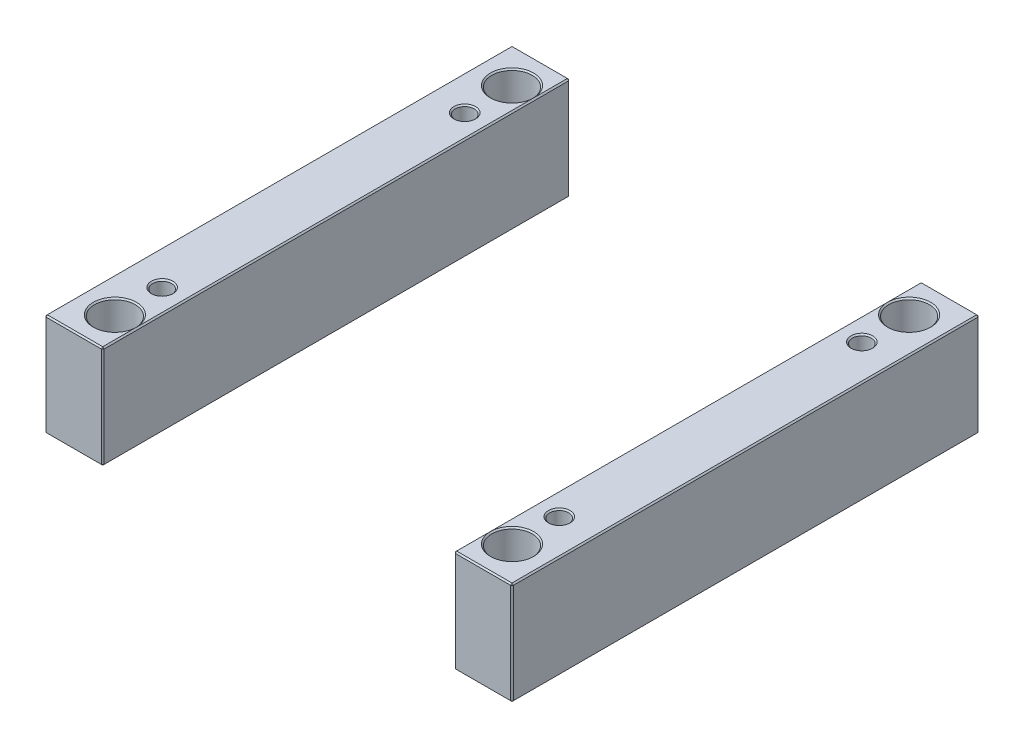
ISO-10303-21;
HEADER;
FILE_DESCRIPTION(('STEP AP214'),'2;1');
FILE_NAME('part.step','',(''),(''),'','','');
FILE_SCHEMA(('AUTOMOTIVE_DESIGN { 1 0 10303 214 1 1 1 1 }'));
ENDSEC;
DATA;
#1=APPLICATION_CONTEXT('core data for automotive mechanical design processes');
#2=APPLICATION_PROTOCOL_DEFINITION('international standard','automotive_design',2000,#1);
#3=PRODUCT_CONTEXT('',#1,'mechanical');
#4=PRODUCT('Part','Part','',(#3));
#5=PRODUCT_RELATED_PRODUCT_CATEGORY('part','',(#4));
#6=PRODUCT_DEFINITION_FORMATION('','',#4);
#7=PRODUCT_DEFINITION_CONTEXT('part definition',#1,'design');
#8=PRODUCT_DEFINITION('design','',#6,#7);
#9=PRODUCT_DEFINITION_SHAPE('','',#8);
#10=(LENGTH_UNIT() NAMED_UNIT(*) SI_UNIT(.MILLI.,.METRE.));
#11=(NAMED_UNIT(*) PLANE_ANGLE_UNIT() SI_UNIT($,.RADIAN.));
#12=(NAMED_UNIT(*) SI_UNIT($,.STERADIAN.) SOLID_ANGLE_UNIT());
#13=UNCERTAINTY_MEASURE_WITH_UNIT(LENGTH_MEASURE(1.E-05),#10,'distance_accuracy_value','');
#14=(GEOMETRIC_REPRESENTATION_CONTEXT(3) GLOBAL_UNCERTAINTY_ASSIGNED_CONTEXT((#13)) GLOBAL_UNIT_ASSIGNED_CONTEXT((#10,
#11,#12)) REPRESENTATION_CONTEXT('',''));
#15=CARTESIAN_POINT('',(0.,0.,0.));
#16=DIRECTION('',(0.,0.,1.));
#17=DIRECTION('',(1.,0.,0.));
#18=AXIS2_PLACEMENT_3D('',#15,#16,#17);
#19=CARTESIAN_POINT('',(-173.,76.,-173.));
#20=DIRECTION('',(0.,0.,1.));
#21=DIRECTION('',(1.,0.,0.));
#22=AXIS2_PLACEMENT_3D('',#19,#20,#21);
#23=PLANE('',#22);
#24=DIRECTION('',(-1.,0.,0.));
#25=VECTOR('',#24,1.);
#26=CARTESIAN_POINT('',(-173.,1.00000000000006,-173.));
#27=LINE('',#26,#25);
#28=CARTESIAN_POINT('',(-131.,1.00000000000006,-173.));
#29=VERTEX_POINT('',#28);
#30=CARTESIAN_POINT('',(-172.,1.00000000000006,-173.));
#31=VERTEX_POINT('',#30);
#32=EDGE_CURVE('P0_E151',#29,#31,#27,.T.);
#33=ORIENTED_EDGE('',*,*,#32,.T.);
#34=DIRECTION('',(0.,1.,0.));
#35=VECTOR('',#34,1.);
#36=CARTESIAN_POINT('',(-172.,76.,-173.));
#37=LINE('',#36,#35);
#38=CARTESIAN_POINT('',(-172.,75.,-173.));
#39=VERTEX_POINT('',#38);
#40=EDGE_CURVE('P0_E266',#31,#39,#37,.T.);
#41=ORIENTED_EDGE('',*,*,#40,.T.);
#42=DIRECTION('',(1.,0.,0.));
#43=VECTOR('',#42,1.);
#44=CARTESIAN_POINT('',(-173.,75.,-173.));
#45=LINE('',#44,#43);
#46=CARTESIAN_POINT('',(-131.,75.,-173.));
#47=VERTEX_POINT('',#46);
#48=EDGE_CURVE('P0_E264',#39,#47,#45,.T.);
#49=ORIENTED_EDGE('',*,*,#48,.T.);
#50=DIRECTION('',(0.,-1.,0.));
#51=VECTOR('',#50,1.);
#52=CARTESIAN_POINT('',(-131.,76.,-173.));
#53=LINE('',#52,#51);
#54=EDGE_CURVE('P0_E261',#47,#29,#53,.T.);
#55=ORIENTED_EDGE('',*,*,#54,.T.);
#56=EDGE_LOOP('',(#33,#41,#49,#55));
#57=FACE_BOUND('',#56,.T.);
#58=ADVANCED_FACE('P0_F16',(#57),#23,.F.);
#59=CARTESIAN_POINT('',(-173.,76.,173.));
#60=DIRECTION('',(1.,0.,0.));
#61=DIRECTION('',(0.,0.,-1.));
#62=AXIS2_PLACEMENT_3D('',#59,#60,#61);
#63=PLANE('',#62);
#64=DIRECTION('',(0.,1.,0.));
#65=VECTOR('',#64,1.);
#66=CARTESIAN_POINT('',(-173.,76.,172.));
#67=LINE('',#66,#65);
#68=CARTESIAN_POINT('',(-173.,1.00000000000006,172.));
#69=VERTEX_POINT('',#68);
#70=CARTESIAN_POINT('',(-173.,75.,172.));
#71=VERTEX_POINT('',#70);
#72=EDGE_CURVE('P0_E254',#69,#71,#67,.T.);
#73=ORIENTED_EDGE('',*,*,#72,.T.);
#74=DIRECTION('',(0.,0.,-1.));
#75=VECTOR('',#74,1.);
#76=CARTESIAN_POINT('',(-173.,75.,173.));
#77=LINE('',#76,#75);
#78=CARTESIAN_POINT('',(-173.,75.,-172.));
#79=VERTEX_POINT('',#78);
#80=EDGE_CURVE('P0_E259',#71,#79,#77,.T.);
#81=ORIENTED_EDGE('',*,*,#80,.T.);
#82=DIRECTION('',(0.,-1.,0.));
#83=VECTOR('',#82,1.);
#84=CARTESIAN_POINT('',(-173.,76.,-172.));
#85=LINE('',#84,#83);
#86=CARTESIAN_POINT('',(-173.,1.00000000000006,-172.));
#87=VERTEX_POINT('',#86);
#88=EDGE_CURVE('P0_E256',#79,#87,#85,.T.);
#89=ORIENTED_EDGE('',*,*,#88,.T.);
#90=DIRECTION('',(0.,0.,1.));
#91=VECTOR('',#90,1.);
#92=CARTESIAN_POINT('',(-173.,1.00000000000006,173.));
#93=LINE('',#92,#91);
#94=EDGE_CURVE('P0_E252',#87,#69,#93,.T.);
#95=ORIENTED_EDGE('',*,*,#94,.T.);
#96=EDGE_LOOP('',(#73,#81,#89,#95));
#97=FACE_BOUND('',#96,.T.);
#98=ADVANCED_FACE('P0_F340',(#97),#63,.F.);
#99=CARTESIAN_POINT('',(-173.,76.,173.));
#100=DIRECTION('',(0.,0.,-1.));
#101=DIRECTION('',(-1.,0.,0.));
#102=AXIS2_PLACEMENT_3D('',#99,#100,#101);
#103=PLANE('',#102);
#104=DIRECTION('',(-1.,0.,0.));
#105=VECTOR('',#104,1.);
#106=CARTESIAN_POINT('',(-173.,75.,173.));
#107=LINE('',#106,#105);
#108=CARTESIAN_POINT('',(-131.,75.,173.));
#109=VERTEX_POINT('',#108);
#110=CARTESIAN_POINT('',(-172.,75.,173.));
#111=VERTEX_POINT('',#110);
#112=EDGE_CURVE('P0_E273',#109,#111,#107,.T.);
#113=ORIENTED_EDGE('',*,*,#112,.T.);
#114=DIRECTION('',(0.,-1.,0.));
#115=VECTOR('',#114,1.);
#116=CARTESIAN_POINT('',(-172.,76.,173.));
#117=LINE('',#116,#115);
#118=CARTESIAN_POINT('',(-172.,1.00000000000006,173.));
#119=VERTEX_POINT('',#118);
#120=EDGE_CURVE('P0_E275',#111,#119,#117,.T.);
#121=ORIENTED_EDGE('',*,*,#120,.T.);
#122=DIRECTION('',(1.,0.,0.));
#123=VECTOR('',#122,1.);
#124=CARTESIAN_POINT('',(-130.,1.00000000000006,173.));
#125=LINE('',#124,#123);
#126=CARTESIAN_POINT('',(-131.,1.00000000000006,173.));
#127=VERTEX_POINT('',#126);
#128=EDGE_CURVE('P0_E271',#119,#127,#125,.T.);
#129=ORIENTED_EDGE('',*,*,#128,.T.);
#130=DIRECTION('',(0.,1.,0.));
#131=VECTOR('',#130,1.);
#132=CARTESIAN_POINT('',(-131.,76.,173.));
#133=LINE('',#132,#131);
#134=EDGE_CURVE('P0_E269',#127,#109,#133,.T.);
#135=ORIENTED_EDGE('',*,*,#134,.T.);
#136=EDGE_LOOP('',(#113,#121,#129,#135));
#137=FACE_BOUND('',#136,.T.);
#138=ADVANCED_FACE('P0_F395',(#137),#103,.F.);
#139=CARTESIAN_POINT('',(-130.,76.,-173.));
#140=DIRECTION('',(-1.,0.,0.));
#141=DIRECTION('',(0.,0.,1.));
#142=AXIS2_PLACEMENT_3D('',#139,#140,#141);
#143=PLANE('',#142);
#144=DIRECTION('',(0.,0.,1.));
#145=VECTOR('',#144,1.);
#146=CARTESIAN_POINT('',(-130.,75.,-173.));
#147=LINE('',#146,#145);
#148=CARTESIAN_POINT('',(-130.,75.,-172.));
#149=VERTEX_POINT('',#148);
#150=CARTESIAN_POINT('',(-130.,75.,172.));
#151=VERTEX_POINT('',#150);
#152=EDGE_CURVE('P0_E294',#149,#151,#147,.T.);
#153=ORIENTED_EDGE('',*,*,#152,.T.);
#154=DIRECTION('',(0.,-1.,0.));
#155=VECTOR('',#154,1.);
#156=CARTESIAN_POINT('',(-130.,76.,172.));
#157=LINE('',#156,#155);
#158=CARTESIAN_POINT('',(-130.,1.00000000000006,172.));
#159=VERTEX_POINT('',#158);
#160=EDGE_CURVE('P0_E206',#151,#159,#157,.T.);
#161=ORIENTED_EDGE('',*,*,#160,.T.);
#162=DIRECTION('',(0.,0.,-1.));
#163=VECTOR('',#162,1.);
#164=CARTESIAN_POINT('',(-130.,1.00000000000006,-173.));
#165=LINE('',#164,#163);
#166=CARTESIAN_POINT('',(-130.,1.00000000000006,-172.));
#167=VERTEX_POINT('',#166);
#168=EDGE_CURVE('P0_E290',#159,#167,#165,.T.);
#169=ORIENTED_EDGE('',*,*,#168,.T.);
#170=DIRECTION('',(0.,1.,0.));
#171=VECTOR('',#170,1.);
#172=CARTESIAN_POINT('',(-130.,76.,-172.));
#173=LINE('',#172,#171);
#174=EDGE_CURVE('P0_E292',#167,#149,#173,.T.);
#175=ORIENTED_EDGE('',*,*,#174,.T.);
#176=EDGE_LOOP('',(#153,#161,#169,#175));
#177=FACE_BOUND('',#176,.T.);
#178=ADVANCED_FACE('P0_F370',(#177),#143,.F.);
#179=CARTESIAN_POINT('',(0.,76.,0.));
#180=DIRECTION('',(0.,-1.,0.));
#181=DIRECTION('',(0.,0.,-1.));
#182=AXIS2_PLACEMENT_3D('',#179,#180,#181);
#183=PLANE('',#182);
#184=CARTESIAN_POINT('',(-147.,76.,112.));
#185=DIRECTION('',(0.,-1.,0.));
#186=DIRECTION('',(0.,0.,-1.));
#187=AXIS2_PLACEMENT_3D('',#184,#185,#186);
#188=CIRCLE('',#187,8.);
#189=CARTESIAN_POINT('',(-147.,76.,104.));
#190=VERTEX_POINT('',#189);
#191=EDGE_CURVE('P0_E209',#190,#190,#188,.T.);
#192=ORIENTED_EDGE('',*,*,#191,.T.);
#193=EDGE_LOOP('',(#192));
#194=FACE_BOUND('',#193,.T.);
#195=CARTESIAN_POINT('',(-147.,76.,-112.));
#196=DIRECTION('',(0.,-1.,0.));
#197=DIRECTION('',(0.,0.,-1.));
#198=AXIS2_PLACEMENT_3D('',#195,#196,#197);
#199=CIRCLE('',#198,8.);
#200=CARTESIAN_POINT('',(-147.,76.,-120.));
#201=VERTEX_POINT('',#200);
#202=EDGE_CURVE('P0_E205',#201,#201,#199,.T.);
#203=ORIENTED_EDGE('',*,*,#202,.T.);
#204=EDGE_LOOP('',(#203));
#205=FACE_BOUND('',#204,.T.);
#206=DIRECTION('',(0.,0.,-1.));
#207=VECTOR('',#206,1.);
#208=CARTESIAN_POINT('',(-131.,76.,0.));
#209=LINE('',#208,#207);
#210=CARTESIAN_POINT('',(-131.,76.,147.));
#211=VERTEX_POINT('',#210);
#212=CARTESIAN_POINT('',(-131.,76.,-147.));
#213=VERTEX_POINT('',#212);
#214=EDGE_CURVE('P0_E283',#211,#213,#209,.T.);
#215=ORIENTED_EDGE('',*,*,#214,.T.);
#216=CARTESIAN_POINT('',(-147.,76.,-147.));
#217=DIRECTION('',(0.,-1.,0.));
#218=DIRECTION('',(0.,0.,-1.));
#219=AXIS2_PLACEMENT_3D('',#216,#217,#218);
#220=CIRCLE('',#219,16.);
#221=EDGE_CURVE('P0_E29',#213,#213,#220,.T.);
#222=ORIENTED_EDGE('',*,*,#221,.T.);
#223=CARTESIAN_POINT('',(-131.,76.,-172.));
#224=VERTEX_POINT('',#223);
#225=EDGE_CURVE('P0_E278',#213,#224,#209,.T.);
#226=ORIENTED_EDGE('',*,*,#225,.T.);
#227=DIRECTION('',(-1.,0.,0.));
#228=VECTOR('',#227,1.);
#229=CARTESIAN_POINT('',(-1.11022302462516E-13,76.,-172.));
#230=LINE('',#229,#228);
#231=CARTESIAN_POINT('',(-172.,76.,-172.));
#232=VERTEX_POINT('',#231);
#233=EDGE_CURVE('P0_E282',#224,#232,#230,.T.);
#234=ORIENTED_EDGE('',*,*,#233,.T.);
#235=DIRECTION('',(0.,0.,1.));
#236=VECTOR('',#235,1.);
#237=CARTESIAN_POINT('',(-172.,76.,0.));
#238=LINE('',#237,#236);
#239=CARTESIAN_POINT('',(-172.,76.,172.));
#240=VERTEX_POINT('',#239);
#241=EDGE_CURVE('P0_E285',#232,#240,#238,.T.);
#242=ORIENTED_EDGE('',*,*,#241,.T.);
#243=DIRECTION('',(1.,0.,0.));
#244=VECTOR('',#243,1.);
#245=CARTESIAN_POINT('',(1.11022302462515E-13,76.,172.));
#246=LINE('',#245,#244);
#247=CARTESIAN_POINT('',(-131.,76.,172.));
#248=VERTEX_POINT('',#247);
#249=EDGE_CURVE('P0_E287',#240,#248,#246,.T.);
#250=ORIENTED_EDGE('',*,*,#249,.T.);
#251=EDGE_CURVE('P0_E279',#248,#211,#209,.T.);
#252=ORIENTED_EDGE('',*,*,#251,.T.);
#253=CARTESIAN_POINT('',(-147.,76.,147.));
#254=DIRECTION('',(0.,-1.,0.));
#255=DIRECTION('',(0.,0.,-1.));
#256=AXIS2_PLACEMENT_3D('',#253,#254,#255);
#257=CIRCLE('',#256,16.);
#258=EDGE_CURVE('P0_E34',#211,#211,#257,.T.);
#259=ORIENTED_EDGE('',*,*,#258,.T.);
#260=EDGE_LOOP('',(#215,#222,#226,#234,#242,#250,#252,#259));
#261=FACE_BOUND('',#260,.T.);
#262=ADVANCED_FACE('P0_F354',(#194,#205,#261),#183,.F.);
#263=CARTESIAN_POINT('',(0.,0.,0.));
#264=DIRECTION('',(0.,-1.,0.));
#265=DIRECTION('',(0.,0.,-1.));
#266=AXIS2_PLACEMENT_3D('',#263,#264,#265);
#267=PLANE('',#266);
#268=CARTESIAN_POINT('',(-147.,0.,-112.));
#269=DIRECTION('',(0.,-1.,0.));
#270=DIRECTION('',(0.,0.,-1.));
#271=AXIS2_PLACEMENT_3D('',#268,#269,#270);
#272=CIRCLE('',#271,8.);
#273=CARTESIAN_POINT('',(-147.,0.,-120.));
#274=VERTEX_POINT('',#273);
#275=EDGE_CURVE('P0_E243',#274,#274,#272,.F.);
#276=ORIENTED_EDGE('',*,*,#275,.T.);
#277=EDGE_LOOP('',(#276));
#278=FACE_BOUND('',#277,.T.);
#279=CARTESIAN_POINT('',(-147.,0.,112.));
#280=DIRECTION('',(0.,-1.,0.));
#281=DIRECTION('',(0.,0.,-1.));
#282=AXIS2_PLACEMENT_3D('',#279,#280,#281);
#283=CIRCLE('',#282,8.);
#284=CARTESIAN_POINT('',(-147.,0.,104.));
#285=VERTEX_POINT('',#284);
#286=EDGE_CURVE('P0_E240',#285,#285,#283,.F.);
#287=ORIENTED_EDGE('',*,*,#286,.T.);
#288=EDGE_LOOP('',(#287));
#289=FACE_BOUND('',#288,.T.);
#290=DIRECTION('',(0.,0.,1.));
#291=VECTOR('',#290,1.);
#292=CARTESIAN_POINT('',(-131.,0.,173.));
#293=LINE('',#292,#291);
#294=CARTESIAN_POINT('',(-131.,0.,-172.));
#295=VERTEX_POINT('',#294);
#296=CARTESIAN_POINT('',(-131.,0.,-147.));
#297=VERTEX_POINT('',#296);
#298=EDGE_CURVE('P0_E120',#295,#297,#293,.T.);
#299=ORIENTED_EDGE('',*,*,#298,.T.);
#300=CARTESIAN_POINT('',(-147.,0.,-147.));
#301=DIRECTION('',(0.,-1.,0.));
#302=DIRECTION('',(0.,0.,-1.));
#303=AXIS2_PLACEMENT_3D('',#300,#301,#302);
#304=CIRCLE('',#303,16.);
#305=EDGE_CURVE('P0_E218',#297,#297,#304,.F.);
#306=ORIENTED_EDGE('',*,*,#305,.T.);
#307=CARTESIAN_POINT('',(-131.,0.,147.));
#308=VERTEX_POINT('',#307);
#309=EDGE_CURVE('P0_E138',#297,#308,#293,.T.);
#310=ORIENTED_EDGE('',*,*,#309,.T.);
#311=CARTESIAN_POINT('',(-147.,0.,147.));
#312=DIRECTION('',(0.,-1.,0.));
#313=DIRECTION('',(0.,0.,-1.));
#314=AXIS2_PLACEMENT_3D('',#311,#312,#313);
#315=CIRCLE('',#314,16.);
#316=EDGE_CURVE('P0_E215',#308,#308,#315,.F.);
#317=ORIENTED_EDGE('',*,*,#316,.T.);
#318=CARTESIAN_POINT('',(-131.,0.,172.));
#319=VERTEX_POINT('',#318);
#320=EDGE_CURVE('P0_E140',#308,#319,#293,.T.);
#321=ORIENTED_EDGE('',*,*,#320,.T.);
#322=DIRECTION('',(-1.,0.,0.));
#323=VECTOR('',#322,1.);
#324=CARTESIAN_POINT('',(-173.,0.,172.));
#325=LINE('',#324,#323);
#326=CARTESIAN_POINT('',(-172.,0.,172.));
#327=VERTEX_POINT('',#326);
#328=EDGE_CURVE('P0_E126',#319,#327,#325,.T.);
#329=ORIENTED_EDGE('',*,*,#328,.T.);
#330=DIRECTION('',(0.,0.,-1.));
#331=VECTOR('',#330,1.);
#332=CARTESIAN_POINT('',(-172.,0.,-173.));
#333=LINE('',#332,#331);
#334=CARTESIAN_POINT('',(-172.,0.,-172.));
#335=VERTEX_POINT('',#334);
#336=EDGE_CURVE('P0_E122',#327,#335,#333,.T.);
#337=ORIENTED_EDGE('',*,*,#336,.T.);
#338=DIRECTION('',(1.,0.,0.));
#339=VECTOR('',#338,1.);
#340=CARTESIAN_POINT('',(-130.,0.,-172.));
#341=LINE('',#340,#339);
#342=EDGE_CURVE('P0_E116',#335,#295,#341,.T.);
#343=ORIENTED_EDGE('',*,*,#342,.T.);
#344=EDGE_LOOP('',(#299,#306,#310,#317,#321,#329,#337,#343));
#345=FACE_BOUND('',#344,.T.);
#346=ADVANCED_FACE('P0_F118',(#278,#289,#345),#267,.T.);
#347=CARTESIAN_POINT('',(-147.,0.,-112.));
#348=DIRECTION('',(0.,1.,0.));
#349=DIRECTION('',(0.,0.,1.));
#350=AXIS2_PLACEMENT_3D('',#347,#348,#349);
#351=CYLINDRICAL_SURFACE('',#350,7.);
#352=CARTESIAN_POINT('',(-147.,75.,-112.));
#353=DIRECTION('',(0.,-1.,0.));
#354=DIRECTION('',(0.,0.,-1.));
#355=AXIS2_PLACEMENT_3D('',#352,#353,#354);
#356=CIRCLE('',#355,7.);
#357=CARTESIAN_POINT('',(-147.,75.,-119.));
#358=VERTEX_POINT('',#357);
#359=EDGE_CURVE('P0_E212',#358,#358,#356,.F.);
#360=ORIENTED_EDGE('',*,*,#359,.T.);
#361=EDGE_LOOP('',(#360));
#362=FACE_BOUND('',#361,.T.);
#363=CARTESIAN_POINT('',(-147.,0.99999999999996,-112.));
#364=DIRECTION('',(0.,-1.,0.));
#365=DIRECTION('',(0.,0.,-1.));
#366=AXIS2_PLACEMENT_3D('',#363,#364,#365);
#367=CIRCLE('',#366,7.);
#368=CARTESIAN_POINT('',(-147.,0.99999999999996,-119.));
#369=VERTEX_POINT('',#368);
#370=EDGE_CURVE('P0_E246',#369,#369,#367,.T.);
#371=ORIENTED_EDGE('',*,*,#370,.T.);
#372=EDGE_LOOP('',(#371));
#373=FACE_BOUND('',#372,.T.);
#374=ADVANCED_FACE('P0_F445',(#362,#373),#351,.F.);
#375=CARTESIAN_POINT('',(-147.,0.,112.));
#376=DIRECTION('',(0.,1.,0.));
#377=DIRECTION('',(0.,0.,1.));
#378=AXIS2_PLACEMENT_3D('',#375,#376,#377);
#379=CYLINDRICAL_SURFACE('',#378,7.);
#380=CARTESIAN_POINT('',(-147.,75.,112.));
#381=DIRECTION('',(0.,-1.,0.));
#382=DIRECTION('',(0.,0.,-1.));
#383=AXIS2_PLACEMENT_3D('',#380,#381,#382);
#384=CIRCLE('',#383,7.);
#385=CARTESIAN_POINT('',(-147.,75.,105.));
#386=VERTEX_POINT('',#385);
#387=EDGE_CURVE('P0_E202',#386,#386,#384,.F.);
#388=ORIENTED_EDGE('',*,*,#387,.T.);
#389=EDGE_LOOP('',(#388));
#390=FACE_BOUND('',#389,.T.);
#391=CARTESIAN_POINT('',(-147.,0.99999999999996,112.));
#392=DIRECTION('',(0.,-1.,0.));
#393=DIRECTION('',(0.,0.,-1.));
#394=AXIS2_PLACEMENT_3D('',#391,#392,#393);
#395=CIRCLE('',#394,7.);
#396=CARTESIAN_POINT('',(-147.,0.99999999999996,105.));
#397=VERTEX_POINT('',#396);
#398=EDGE_CURVE('P0_E249',#397,#397,#395,.T.);
#399=ORIENTED_EDGE('',*,*,#398,.T.);
#400=EDGE_LOOP('',(#399));
#401=FACE_BOUND('',#400,.T.);
#402=ADVANCED_FACE('P0_F403',(#390,#401),#379,.F.);
#403=CARTESIAN_POINT('',(-147.,0.,-112.));
#404=DIRECTION('',(0.,-1.,0.));
#405=DIRECTION('',(0.,0.,-1.));
#406=AXIS2_PLACEMENT_3D('',#403,#404,#405);
#407=CONICAL_SURFACE('',#406,8.,0.78539816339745);
#408=ORIENTED_EDGE('',*,*,#370,.F.);
#409=EDGE_LOOP('',(#408));
#410=FACE_BOUND('',#409,.T.);
#411=ORIENTED_EDGE('',*,*,#275,.F.);
#412=EDGE_LOOP('',(#411));
#413=FACE_BOUND('',#412,.T.);
#414=ADVANCED_FACE('P0_F399',(#410,#413),#407,.F.);
#415=CARTESIAN_POINT('',(-147.,0.,112.));
#416=DIRECTION('',(0.,-1.,0.));
#417=DIRECTION('',(0.,0.,-1.));
#418=AXIS2_PLACEMENT_3D('',#415,#416,#417);
#419=CONICAL_SURFACE('',#418,8.,0.78539816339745);
#420=ORIENTED_EDGE('',*,*,#398,.F.);
#421=EDGE_LOOP('',(#420));
#422=FACE_BOUND('',#421,.T.);
#423=ORIENTED_EDGE('',*,*,#286,.F.);
#424=EDGE_LOOP('',(#423));
#425=FACE_BOUND('',#424,.T.);
#426=ADVANCED_FACE('P0_F402',(#422,#425),#419,.F.);
#427=CARTESIAN_POINT('',(-130.,76.,172.));
#428=DIRECTION('',(-0.707106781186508,0.,-0.707106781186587));
#429=DIRECTION('',(0.,-1.,0.));
#430=AXIS2_PLACEMENT_3D('',#427,#428,#429);
#431=PLANE('',#430);
#432=DIRECTION('',(-0.707106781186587,0.,0.707106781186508));
#433=VECTOR('',#432,1.);
#434=CARTESIAN_POINT('',(-130.5,75.,172.5));
#435=LINE('',#434,#433);
#436=EDGE_CURVE('P0_E199',#109,#151,#435,.F.);
#437=ORIENTED_EDGE('',*,*,#436,.F.);
#438=ORIENTED_EDGE('',*,*,#134,.F.);
#439=DIRECTION('',(0.707106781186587,0.,-0.707106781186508));
#440=VECTOR('',#439,1.);
#441=CARTESIAN_POINT('',(-131.,1.00000000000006,173.));
#442=LINE('',#441,#440);
#443=EDGE_CURVE('P0_E196',#159,#127,#442,.F.);
#444=ORIENTED_EDGE('',*,*,#443,.F.);
#445=ORIENTED_EDGE('',*,*,#160,.F.);
#446=EDGE_LOOP('',(#437,#438,#444,#445));
#447=FACE_BOUND('',#446,.T.);
#448=ADVANCED_FACE('P0_F367',(#447),#431,.F.);
#449=CARTESIAN_POINT('',(-131.,76.,172.));
#450=DIRECTION('',(0.577350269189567,0.577350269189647,0.577350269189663));
#451=DIRECTION('',(0.,-0.707106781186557,0.707106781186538));
#452=AXIS2_PLACEMENT_3D('',#449,#450,#451);
#453=PLANE('',#452);
#454=DIRECTION('',(0.,0.707106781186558,-0.707106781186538));
#455=VECTOR('',#454,1.);
#456=CARTESIAN_POINT('',(-131.,76.,172.));
#457=LINE('',#456,#455);
#458=EDGE_CURVE('P0_E190',#109,#248,#457,.T.);
#459=ORIENTED_EDGE('',*,*,#458,.F.);
#460=ORIENTED_EDGE('',*,*,#436,.T.);
#461=DIRECTION('',(0.707106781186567,-0.707106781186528,0.));
#462=VECTOR('',#461,1.);
#463=CARTESIAN_POINT('',(-131.,76.,172.));
#464=LINE('',#463,#462);
#465=EDGE_CURVE('P0_E193',#248,#151,#464,.T.);
#466=ORIENTED_EDGE('',*,*,#465,.F.);
#467=EDGE_LOOP('',(#459,#460,#466));
#468=FACE_BOUND('',#467,.T.);
#469=ADVANCED_FACE('P0_F362',(#468),#453,.T.);
#470=CARTESIAN_POINT('',(-131.,1.00000000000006,173.));
#471=DIRECTION('',(0.577350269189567,-0.577350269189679,0.577350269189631));
#472=DIRECTION('',(0.,-0.707106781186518,-0.707106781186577));
#473=AXIS2_PLACEMENT_3D('',#470,#471,#472);
#474=PLANE('',#473);
#475=DIRECTION('',(0.707106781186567,0.707106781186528,0.));
#476=VECTOR('',#475,1.);
#477=CARTESIAN_POINT('',(-130.5,0.50000000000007,172.));
#478=LINE('',#477,#476);
#479=EDGE_CURVE('P0_E185',#159,#319,#478,.F.);
#480=ORIENTED_EDGE('',*,*,#479,.F.);
#481=ORIENTED_EDGE('',*,*,#443,.T.);
#482=DIRECTION('',(0.,-0.707106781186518,-0.707106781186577));
#483=VECTOR('',#482,1.);
#484=CARTESIAN_POINT('',(-131.,1.00000000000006,173.));
#485=LINE('',#484,#483);
#486=EDGE_CURVE('P0_E187',#319,#127,#485,.F.);
#487=ORIENTED_EDGE('',*,*,#486,.F.);
#488=EDGE_LOOP('',(#480,#481,#487));
#489=FACE_BOUND('',#488,.T.);
#490=ADVANCED_FACE('P0_F492',(#489),#474,.T.);
#491=CARTESIAN_POINT('',(-131.,76.,0.));
#492=DIRECTION('',(-0.707106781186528,-0.707106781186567,0.));
#493=DIRECTION('',(0.,0.,-1.));
#494=AXIS2_PLACEMENT_3D('',#491,#492,#493);
#495=PLANE('',#494);
#496=ORIENTED_EDGE('',*,*,#465,.T.);
#497=ORIENTED_EDGE('',*,*,#152,.F.);
#498=DIRECTION('',(-0.707106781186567,0.707106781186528,0.));
#499=VECTOR('',#498,1.);
#500=CARTESIAN_POINT('',(-130.5,75.5,-172.));
#501=LINE('',#500,#499);
#502=EDGE_CURVE('P0_E179',#224,#149,#501,.F.);
#503=ORIENTED_EDGE('',*,*,#502,.F.);
#504=ORIENTED_EDGE('',*,*,#225,.F.);
#505=ORIENTED_EDGE('',*,*,#214,.F.);
#506=ORIENTED_EDGE('',*,*,#251,.F.);
#507=EDGE_LOOP('',(#496,#497,#503,#504,#505,#506));
#508=FACE_BOUND('',#507,.T.);
#509=ADVANCED_FACE('P0_F358',(#508),#495,.F.);
#510=CARTESIAN_POINT('',(1.11022302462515E-13,76.,172.));
#511=DIRECTION('',(0.,-0.707106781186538,-0.707106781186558));
#512=DIRECTION('',(1.,0.,0.));
#513=AXIS2_PLACEMENT_3D('',#510,#511,#512);
#514=PLANE('',#513);
#515=ORIENTED_EDGE('',*,*,#458,.T.);
#516=ORIENTED_EDGE('',*,*,#249,.F.);
#517=DIRECTION('',(0.,-0.707106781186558,0.707106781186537));
#518=VECTOR('',#517,1.);
#519=CARTESIAN_POINT('',(-172.,75.5,172.5));
#520=LINE('',#519,#518);
#521=EDGE_CURVE('P0_E176',#111,#240,#520,.F.);
#522=ORIENTED_EDGE('',*,*,#521,.F.);
#523=ORIENTED_EDGE('',*,*,#112,.F.);
#524=EDGE_LOOP('',(#515,#516,#522,#523));
#525=FACE_BOUND('',#524,.T.);
#526=ADVANCED_FACE('P0_F351',(#525),#514,.F.);
#527=CARTESIAN_POINT('',(-172.,76.,173.));
#528=DIRECTION('',(0.707106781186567,0.,-0.707106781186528));
#529=DIRECTION('',(0.,-1.,0.));
#530=AXIS2_PLACEMENT_3D('',#527,#528,#529);
#531=PLANE('',#530);
#532=DIRECTION('',(0.707106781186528,0.,0.707106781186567));
#533=VECTOR('',#532,1.);
#534=CARTESIAN_POINT('',(-172.,1.00000000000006,173.));
#535=LINE('',#534,#533);
#536=EDGE_CURVE('P0_E170',#119,#69,#535,.F.);
#537=ORIENTED_EDGE('',*,*,#536,.F.);
#538=ORIENTED_EDGE('',*,*,#120,.F.);
#539=DIRECTION('',(-0.707106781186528,0.,-0.707106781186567));
#540=VECTOR('',#539,1.);
#541=CARTESIAN_POINT('',(-173.,75.,172.));
#542=LINE('',#541,#540);
#543=EDGE_CURVE('P0_E173',#71,#111,#542,.F.);
#544=ORIENTED_EDGE('',*,*,#543,.F.);
#545=ORIENTED_EDGE('',*,*,#72,.F.);
#546=EDGE_LOOP('',(#537,#538,#544,#545));
#547=FACE_BOUND('',#546,.T.);
#548=ADVANCED_FACE('P0_F345',(#547),#531,.F.);
#549=CARTESIAN_POINT('',(-173.,1.00000000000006,173.));
#550=DIRECTION('',(0.,-0.707106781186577,0.707106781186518));
#551=DIRECTION('',(-1.,0.,0.));
#552=AXIS2_PLACEMENT_3D('',#549,#550,#551);
#553=PLANE('',#552);
#554=ORIENTED_EDGE('',*,*,#486,.T.);
#555=ORIENTED_EDGE('',*,*,#128,.F.);
#556=DIRECTION('',(0.,0.707106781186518,0.707106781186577));
#557=VECTOR('',#556,1.);
#558=CARTESIAN_POINT('',(-172.,1.00000000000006,173.));
#559=LINE('',#558,#557);
#560=EDGE_CURVE('P0_E148',#327,#119,#559,.T.);
#561=ORIENTED_EDGE('',*,*,#560,.F.);
#562=ORIENTED_EDGE('',*,*,#328,.F.);
#563=EDGE_LOOP('',(#554,#555,#561,#562));
#564=FACE_BOUND('',#563,.T.);
#565=ADVANCED_FACE('P0_F434',(#564),#553,.T.);
#566=CARTESIAN_POINT('',(-130.,1.00000000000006,-173.));
#567=DIRECTION('',(0.707106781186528,-0.707106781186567,0.));
#568=DIRECTION('',(0.,0.,1.));
#569=AXIS2_PLACEMENT_3D('',#566,#567,#568);
#570=PLANE('',#569);
#571=ORIENTED_EDGE('',*,*,#479,.T.);
#572=ORIENTED_EDGE('',*,*,#320,.F.);
#573=ORIENTED_EDGE('',*,*,#309,.F.);
#574=ORIENTED_EDGE('',*,*,#298,.F.);
#575=DIRECTION('',(-0.707106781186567,-0.707106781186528,0.));
#576=VECTOR('',#575,1.);
#577=CARTESIAN_POINT('',(-131.,0.,-172.));
#578=LINE('',#577,#576);
#579=EDGE_CURVE('P0_E134',#167,#295,#578,.T.);
#580=ORIENTED_EDGE('',*,*,#579,.F.);
#581=ORIENTED_EDGE('',*,*,#168,.F.);
#582=EDGE_LOOP('',(#571,#572,#573,#574,#580,#581));
#583=FACE_BOUND('',#582,.T.);
#584=ADVANCED_FACE('P0_F133',(#583),#570,.T.);
#585=CARTESIAN_POINT('',(-131.,76.,-173.));
#586=DIRECTION('',(-0.707106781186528,0.,0.707106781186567));
#587=DIRECTION('',(0.,-1.,0.));
#588=AXIS2_PLACEMENT_3D('',#585,#586,#587);
#589=PLANE('',#588);
#590=DIRECTION('',(0.707106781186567,0.,0.707106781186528));
#591=VECTOR('',#590,1.);
#592=CARTESIAN_POINT('',(-131.,75.,-173.));
#593=LINE('',#592,#591);
#594=EDGE_CURVE('P0_E182',#149,#47,#593,.F.);
#595=ORIENTED_EDGE('',*,*,#594,.F.);
#596=ORIENTED_EDGE('',*,*,#174,.F.);
#597=DIRECTION('',(-0.707106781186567,0.,-0.707106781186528));
#598=VECTOR('',#597,1.);
#599=CARTESIAN_POINT('',(-130.5,1.00000000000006,-172.5));
#600=LINE('',#599,#598);
#601=EDGE_CURVE('P0_E147',#29,#167,#600,.F.);
#602=ORIENTED_EDGE('',*,*,#601,.F.);
#603=ORIENTED_EDGE('',*,*,#54,.F.);
#604=EDGE_LOOP('',(#595,#596,#602,#603));
#605=FACE_BOUND('',#604,.T.);
#606=ADVANCED_FACE('P0_F375',(#605),#589,.F.);
#607=CARTESIAN_POINT('',(-131.,75.,-173.));
#608=DIRECTION('',(0.577350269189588,0.577350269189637,-0.577350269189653));
#609=DIRECTION('',(0.,0.707106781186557,0.707106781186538));
#610=AXIS2_PLACEMENT_3D('',#607,#608,#609);
#611=PLANE('',#610);
#612=ORIENTED_EDGE('',*,*,#502,.T.);
#613=ORIENTED_EDGE('',*,*,#594,.T.);
#614=DIRECTION('',(0.,-0.707106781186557,-0.707106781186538));
#615=VECTOR('',#614,1.);
#616=CARTESIAN_POINT('',(-131.,75.,-173.));
#617=LINE('',#616,#615);
#618=EDGE_CURVE('P0_E165',#224,#47,#617,.T.);
#619=ORIENTED_EDGE('',*,*,#618,.F.);
#620=EDGE_LOOP('',(#612,#613,#619));
#621=FACE_BOUND('',#620,.T.);
#622=ADVANCED_FACE('P0_F377',(#621),#611,.T.);
#623=CARTESIAN_POINT('',(-173.,75.,172.));
#624=DIRECTION('',(-0.577350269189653,0.577350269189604,0.57735026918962));
#625=DIRECTION('',(0.707106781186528,0.,0.707106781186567));
#626=AXIS2_PLACEMENT_3D('',#623,#624,#625);
#627=PLANE('',#626);
#628=ORIENTED_EDGE('',*,*,#543,.T.);
#629=ORIENTED_EDGE('',*,*,#521,.T.);
#630=DIRECTION('',(0.707106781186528,0.707106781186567,0.));
#631=VECTOR('',#630,1.);
#632=CARTESIAN_POINT('',(-173.,75.,172.));
#633=LINE('',#632,#631);
#634=EDGE_CURVE('P0_E156',#71,#240,#633,.T.);
#635=ORIENTED_EDGE('',*,*,#634,.F.);
#636=EDGE_LOOP('',(#628,#629,#635));
#637=FACE_BOUND('',#636,.T.);
#638=ADVANCED_FACE('P0_F348',(#637),#627,.T.);
#639=CARTESIAN_POINT('',(-172.,1.00000000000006,173.));
#640=DIRECTION('',(-0.57735026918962,-0.577350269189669,0.577350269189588));
#641=DIRECTION('',(0.707106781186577,-0.707106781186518,0.));
#642=AXIS2_PLACEMENT_3D('',#639,#640,#641);
#643=PLANE('',#642);
#644=ORIENTED_EDGE('',*,*,#560,.T.);
#645=ORIENTED_EDGE('',*,*,#536,.T.);
#646=DIRECTION('',(0.707106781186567,-0.707106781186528,0.));
#647=VECTOR('',#646,1.);
#648=CARTESIAN_POINT('',(-172.5,0.500000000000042,172.));
#649=LINE('',#648,#647);
#650=EDGE_CURVE('P0_E152',#327,#69,#649,.F.);
#651=ORIENTED_EDGE('',*,*,#650,.F.);
#652=EDGE_LOOP('',(#644,#645,#651));
#653=FACE_BOUND('',#652,.T.);
#654=ADVANCED_FACE('P0_F386',(#653),#643,.T.);
#655=CARTESIAN_POINT('',(-131.,0.,-172.));
#656=DIRECTION('',(0.577350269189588,-0.577350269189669,-0.57735026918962));
#657=DIRECTION('',(0.,0.707106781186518,-0.707106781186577));
#658=AXIS2_PLACEMENT_3D('',#655,#656,#657);
#659=PLANE('',#658);
#660=ORIENTED_EDGE('',*,*,#601,.T.);
#661=ORIENTED_EDGE('',*,*,#579,.T.);
#662=DIRECTION('',(0.,0.707106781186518,-0.707106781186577));
#663=VECTOR('',#662,1.);
#664=CARTESIAN_POINT('',(-131.,0.,-172.));
#665=LINE('',#664,#663);
#666=EDGE_CURVE('P0_E144',#29,#295,#665,.F.);
#667=ORIENTED_EDGE('',*,*,#666,.F.);
#668=EDGE_LOOP('',(#660,#661,#667));
#669=FACE_BOUND('',#668,.T.);
#670=ADVANCED_FACE('P0_F143',(#669),#659,.T.);
#671=CARTESIAN_POINT('',(-1.11022302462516E-13,76.,-172.));
#672=DIRECTION('',(0.,-0.707106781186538,0.707106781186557));
#673=DIRECTION('',(-1.,0.,0.));
#674=AXIS2_PLACEMENT_3D('',#671,#672,#673);
#675=PLANE('',#674);
#676=ORIENTED_EDGE('',*,*,#618,.T.);
#677=ORIENTED_EDGE('',*,*,#48,.F.);
#678=DIRECTION('',(0.,0.707106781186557,0.707106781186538));
#679=VECTOR('',#678,1.);
#680=CARTESIAN_POINT('',(-172.,75.,-173.));
#681=LINE('',#680,#679);
#682=EDGE_CURVE('P0_E153',#232,#39,#681,.F.);
#683=ORIENTED_EDGE('',*,*,#682,.F.);
#684=ORIENTED_EDGE('',*,*,#233,.F.);
#685=EDGE_LOOP('',(#676,#677,#683,#684));
#686=FACE_BOUND('',#685,.T.);
#687=ADVANCED_FACE('P0_F323',(#686),#675,.F.);
#688=CARTESIAN_POINT('',(-172.,76.,0.));
#689=DIRECTION('',(0.707106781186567,-0.707106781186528,0.));
#690=DIRECTION('',(0.,0.,1.));
#691=AXIS2_PLACEMENT_3D('',#688,#689,#690);
#692=PLANE('',#691);
#693=ORIENTED_EDGE('',*,*,#634,.T.);
#694=ORIENTED_EDGE('',*,*,#241,.F.);
#695=DIRECTION('',(-0.707106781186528,-0.707106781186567,0.));
#696=VECTOR('',#695,1.);
#697=CARTESIAN_POINT('',(-172.5,75.5,-172.));
#698=LINE('',#697,#696);
#699=EDGE_CURVE('P0_E159',#79,#232,#698,.F.);
#700=ORIENTED_EDGE('',*,*,#699,.F.);
#701=ORIENTED_EDGE('',*,*,#80,.F.);
#702=EDGE_LOOP('',(#693,#694,#700,#701));
#703=FACE_BOUND('',#702,.T.);
#704=ADVANCED_FACE('P0_F317',(#703),#692,.F.);
#705=CARTESIAN_POINT('',(-173.,1.00000000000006,173.));
#706=DIRECTION('',(-0.707106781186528,-0.707106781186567,0.));
#707=DIRECTION('',(0.,0.,-1.));
#708=AXIS2_PLACEMENT_3D('',#705,#706,#707);
#709=PLANE('',#708);
#710=ORIENTED_EDGE('',*,*,#650,.T.);
#711=ORIENTED_EDGE('',*,*,#94,.F.);
#712=DIRECTION('',(-0.707106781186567,0.707106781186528,0.));
#713=VECTOR('',#712,1.);
#714=CARTESIAN_POINT('',(-173.,1.00000000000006,-172.));
#715=LINE('',#714,#713);
#716=EDGE_CURVE('P0_E304',#335,#87,#715,.T.);
#717=ORIENTED_EDGE('',*,*,#716,.F.);
#718=ORIENTED_EDGE('',*,*,#336,.F.);
#719=EDGE_LOOP('',(#710,#711,#717,#718));
#720=FACE_BOUND('',#719,.T.);
#721=ADVANCED_FACE('P0_F336',(#720),#709,.T.);
#722=CARTESIAN_POINT('',(-173.,1.00000000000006,-173.));
#723=DIRECTION('',(0.,-0.707106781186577,-0.707106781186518));
#724=DIRECTION('',(1.,0.,0.));
#725=AXIS2_PLACEMENT_3D('',#722,#723,#724);
#726=PLANE('',#725);
#727=ORIENTED_EDGE('',*,*,#666,.T.);
#728=ORIENTED_EDGE('',*,*,#342,.F.);
#729=DIRECTION('',(0.,-0.707106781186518,0.707106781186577));
#730=VECTOR('',#729,1.);
#731=CARTESIAN_POINT('',(-172.,0.500000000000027,-172.5));
#732=LINE('',#731,#730);
#733=EDGE_CURVE('P0_E302',#31,#335,#732,.T.);
#734=ORIENTED_EDGE('',*,*,#733,.F.);
#735=ORIENTED_EDGE('',*,*,#32,.F.);
#736=EDGE_LOOP('',(#727,#728,#734,#735));
#737=FACE_BOUND('',#736,.T.);
#738=ADVANCED_FACE('P0_F150',(#737),#726,.T.);
#739=CARTESIAN_POINT('',(-172.,75.,-173.));
#740=DIRECTION('',(-0.577350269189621,0.577350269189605,-0.577350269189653));
#741=DIRECTION('',(-0.707106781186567,0.,0.707106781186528));
#742=AXIS2_PLACEMENT_3D('',#739,#740,#741);
#743=PLANE('',#742);
#744=ORIENTED_EDGE('',*,*,#699,.T.);
#745=ORIENTED_EDGE('',*,*,#682,.T.);
#746=DIRECTION('',(0.707106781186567,0.,-0.707106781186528));
#747=VECTOR('',#746,1.);
#748=CARTESIAN_POINT('',(-172.,75.,-173.));
#749=LINE('',#748,#747);
#750=EDGE_CURVE('P0_E300',#79,#39,#749,.T.);
#751=ORIENTED_EDGE('',*,*,#750,.F.);
#752=EDGE_LOOP('',(#744,#745,#751));
#753=FACE_BOUND('',#752,.T.);
#754=ADVANCED_FACE('P0_F310',(#753),#743,.T.);
#755=CARTESIAN_POINT('',(-173.,1.00000000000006,-172.));
#756=DIRECTION('',(-0.577350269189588,-0.577350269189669,-0.57735026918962));
#757=DIRECTION('',(0.,0.707106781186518,-0.707106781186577));
#758=AXIS2_PLACEMENT_3D('',#755,#756,#757);
#759=PLANE('',#758);
#760=ORIENTED_EDGE('',*,*,#733,.T.);
#761=ORIENTED_EDGE('',*,*,#716,.T.);
#762=DIRECTION('',(-0.707106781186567,0.,0.707106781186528));
#763=VECTOR('',#762,1.);
#764=CARTESIAN_POINT('',(-173.,1.00000000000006,-172.));
#765=LINE('',#764,#763);
#766=EDGE_CURVE('P0_E298',#31,#87,#765,.T.);
#767=ORIENTED_EDGE('',*,*,#766,.F.);
#768=EDGE_LOOP('',(#760,#761,#767));
#769=FACE_BOUND('',#768,.T.);
#770=ADVANCED_FACE('P0_F332',(#769),#759,.T.);
#771=CARTESIAN_POINT('',(-173.,76.,-172.));
#772=DIRECTION('',(0.707106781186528,0.,0.707106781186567));
#773=DIRECTION('',(0.,-1.,0.));
#774=AXIS2_PLACEMENT_3D('',#771,#772,#773);
#775=PLANE('',#774);
#776=ORIENTED_EDGE('',*,*,#750,.T.);
#777=ORIENTED_EDGE('',*,*,#40,.F.);
#778=ORIENTED_EDGE('',*,*,#766,.T.);
#779=ORIENTED_EDGE('',*,*,#88,.F.);
#780=EDGE_LOOP('',(#776,#777,#778,#779));
#781=FACE_BOUND('',#780,.T.);
#782=ADVANCED_FACE('P0_F330',(#781),#775,.F.);
#783=CARTESIAN_POINT('',(-147.,75.,112.));
#784=DIRECTION('',(0.,1.,0.));
#785=DIRECTION('',(0.,0.,1.));
#786=AXIS2_PLACEMENT_3D('',#783,#784,#785);
#787=CONICAL_SURFACE('',#786,7.,0.785398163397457);
#788=ORIENTED_EDGE('',*,*,#191,.F.);
#789=EDGE_LOOP('',(#788));
#790=FACE_BOUND('',#789,.T.);
#791=ORIENTED_EDGE('',*,*,#387,.F.);
#792=EDGE_LOOP('',(#791));
#793=FACE_BOUND('',#792,.T.);
#794=ADVANCED_FACE('P0_F410',(#790,#793),#787,.F.);
#795=CARTESIAN_POINT('',(-147.,75.,-112.));
#796=DIRECTION('',(0.,1.,0.));
#797=DIRECTION('',(0.,0.,1.));
#798=AXIS2_PLACEMENT_3D('',#795,#796,#797);
#799=CONICAL_SURFACE('',#798,7.,0.785398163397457);
#800=ORIENTED_EDGE('',*,*,#202,.F.);
#801=EDGE_LOOP('',(#800));
#802=FACE_BOUND('',#801,.T.);
#803=ORIENTED_EDGE('',*,*,#359,.F.);
#804=EDGE_LOOP('',(#803));
#805=FACE_BOUND('',#804,.T.);
#806=ADVANCED_FACE('P0_F459',(#802,#805),#799,.F.);
#807=CARTESIAN_POINT('',(-147.,0.,147.));
#808=DIRECTION('',(0.,1.,0.));
#809=DIRECTION('',(0.,0.,1.));
#810=AXIS2_PLACEMENT_3D('',#807,#808,#809);
#811=CYLINDRICAL_SURFACE('',#810,15.);
#812=CARTESIAN_POINT('',(-147.,75.,147.));
#813=DIRECTION('',(0.,-1.,0.));
#814=DIRECTION('',(0.,0.,-1.));
#815=AXIS2_PLACEMENT_3D('',#812,#813,#814);
#816=CIRCLE('',#815,15.);
#817=CARTESIAN_POINT('',(-147.,75.,132.));
#818=VERTEX_POINT('',#817);
#819=EDGE_CURVE('P0_E10',#818,#818,#816,.F.);
#820=ORIENTED_EDGE('',*,*,#819,.T.);
#821=EDGE_LOOP('',(#820));
#822=FACE_BOUND('',#821,.T.);
#823=CARTESIAN_POINT('',(-147.,0.9999999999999,147.));
#824=DIRECTION('',(0.,-1.,0.));
#825=DIRECTION('',(0.,0.,-1.));
#826=AXIS2_PLACEMENT_3D('',#823,#824,#825);
#827=CIRCLE('',#826,15.);
#828=CARTESIAN_POINT('',(-147.,0.9999999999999,132.));
#829=VERTEX_POINT('',#828);
#830=EDGE_CURVE('P0_E24',#829,#829,#827,.T.);
#831=ORIENTED_EDGE('',*,*,#830,.T.);
#832=EDGE_LOOP('',(#831));
#833=FACE_BOUND('',#832,.T.);
#834=ADVANCED_FACE('P0_F230',(#822,#833),#811,.F.);
#835=CARTESIAN_POINT('',(-147.,0.,-147.));
#836=DIRECTION('',(0.,1.,0.));
#837=DIRECTION('',(0.,0.,1.));
#838=AXIS2_PLACEMENT_3D('',#835,#836,#837);
#839=CYLINDRICAL_SURFACE('',#838,15.);
#840=CARTESIAN_POINT('',(-147.,0.999999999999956,-147.));
#841=DIRECTION('',(0.,-1.,0.));
#842=DIRECTION('',(0.,0.,-1.));
#843=AXIS2_PLACEMENT_3D('',#840,#841,#842);
#844=CIRCLE('',#843,15.);
#845=CARTESIAN_POINT('',(-147.,0.999999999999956,-162.));
#846=VERTEX_POINT('',#845);
#847=EDGE_CURVE('P0_E223',#846,#846,#844,.T.);
#848=ORIENTED_EDGE('',*,*,#847,.T.);
#849=EDGE_LOOP('',(#848));
#850=FACE_BOUND('',#849,.T.);
#851=CARTESIAN_POINT('',(-147.,75.,-147.));
#852=DIRECTION('',(0.,-1.,0.));
#853=DIRECTION('',(0.,0.,-1.));
#854=AXIS2_PLACEMENT_3D('',#851,#852,#853);
#855=CIRCLE('',#854,15.);
#856=CARTESIAN_POINT('',(-147.,75.,-162.));
#857=VERTEX_POINT('',#856);
#858=EDGE_CURVE('P0_E220',#857,#857,#855,.F.);
#859=ORIENTED_EDGE('',*,*,#858,.T.);
#860=EDGE_LOOP('',(#859));
#861=FACE_BOUND('',#860,.T.);
#862=ADVANCED_FACE('P0_F458',(#850,#861),#839,.F.);
#863=CARTESIAN_POINT('',(-147.,0.,-147.));
#864=DIRECTION('',(0.,-1.,0.));
#865=DIRECTION('',(0.,0.,-1.));
#866=AXIS2_PLACEMENT_3D('',#863,#864,#865);
#867=CONICAL_SURFACE('',#866,16.,0.785398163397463);
#868=ORIENTED_EDGE('',*,*,#847,.F.);
#869=EDGE_LOOP('',(#868));
#870=FACE_BOUND('',#869,.T.);
#871=ORIENTED_EDGE('',*,*,#305,.F.);
#872=EDGE_LOOP('',(#871));
#873=FACE_BOUND('',#872,.T.);
#874=ADVANCED_FACE('P0_F462',(#870,#873),#867,.F.);
#875=CARTESIAN_POINT('',(-147.,75.,-147.));
#876=DIRECTION('',(0.,1.,0.));
#877=DIRECTION('',(0.,0.,1.));
#878=AXIS2_PLACEMENT_3D('',#875,#876,#877);
#879=CONICAL_SURFACE('',#878,15.,0.785398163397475);
#880=ORIENTED_EDGE('',*,*,#221,.F.);
#881=EDGE_LOOP('',(#880));
#882=FACE_BOUND('',#881,.T.);
#883=ORIENTED_EDGE('',*,*,#858,.F.);
#884=EDGE_LOOP('',(#883));
#885=FACE_BOUND('',#884,.T.);
#886=ADVANCED_FACE('P0_F468',(#882,#885),#879,.F.);
#887=CARTESIAN_POINT('',(-147.,75.,147.));
#888=DIRECTION('',(0.,1.,0.));
#889=DIRECTION('',(0.,0.,1.));
#890=AXIS2_PLACEMENT_3D('',#887,#888,#889);
#891=CONICAL_SURFACE('',#890,15.,0.785398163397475);
#892=ORIENTED_EDGE('',*,*,#258,.F.);
#893=EDGE_LOOP('',(#892));
#894=FACE_BOUND('',#893,.T.);
#895=ORIENTED_EDGE('',*,*,#819,.F.);
#896=EDGE_LOOP('',(#895));
#897=FACE_BOUND('',#896,.T.);
#898=ADVANCED_FACE('P0_F234',(#894,#897),#891,.F.);
#899=CARTESIAN_POINT('',(-147.,0.,147.));
#900=DIRECTION('',(0.,-1.,0.));
#901=DIRECTION('',(0.,0.,-1.));
#902=AXIS2_PLACEMENT_3D('',#899,#900,#901);
#903=CONICAL_SURFACE('',#902,16.,0.785398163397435);
#904=ORIENTED_EDGE('',*,*,#830,.F.);
#905=EDGE_LOOP('',(#904));
#906=FACE_BOUND('',#905,.T.);
#907=ORIENTED_EDGE('',*,*,#316,.F.);
#908=EDGE_LOOP('',(#907));
#909=FACE_BOUND('',#908,.T.);
#910=ADVANCED_FACE('P0_F18',(#906,#909),#903,.F.);
#911=CLOSED_SHELL('',(#58,#98,#138,#178,#262,#346,#374,#402,#414,#426,#448,#469,#490,#509,#526,
#548,#565,#584,#606,#622,#638,#654,#670,#687,#704,#721,#738,#754,#770,#782,#794,#806,#834,#862,
#874,#886,#898,#910));
#912=MANIFOLD_SOLID_BREP('P0_B1',#911);
#913=CARTESIAN_POINT('',(173.,76.,173.));
#914=DIRECTION('',(0.,0.,-1.));
#915=DIRECTION('',(-1.,0.,0.));
#916=AXIS2_PLACEMENT_3D('',#913,#914,#915);
#917=PLANE('',#916);
#918=DIRECTION('',(0.,-1.,0.));
#919=VECTOR('',#918,1.);
#920=CARTESIAN_POINT('',(131.,76.,173.));
#921=LINE('',#920,#919);
#922=CARTESIAN_POINT('',(131.,75.,173.));
#923=VERTEX_POINT('',#922);
#924=CARTESIAN_POINT('',(131.,0.999999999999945,173.));
#925=VERTEX_POINT('',#924);
#926=EDGE_CURVE('P1_E189',#923,#925,#921,.T.);
#927=ORIENTED_EDGE('',*,*,#926,.T.);
#928=DIRECTION('',(1.,0.,0.));
#929=VECTOR('',#928,1.);
#930=CARTESIAN_POINT('',(173.,0.999999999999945,173.));
#931=LINE('',#930,#929);
#932=CARTESIAN_POINT('',(172.,0.999999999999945,173.));
#933=VERTEX_POINT('',#932);
#934=EDGE_CURVE('P1_E191',#925,#933,#931,.T.);
#935=ORIENTED_EDGE('',*,*,#934,.T.);
#936=DIRECTION('',(0.,1.,0.));
#937=VECTOR('',#936,1.);
#938=CARTESIAN_POINT('',(172.,76.,173.));
#939=LINE('',#938,#937);
#940=CARTESIAN_POINT('',(172.,75.,173.));
#941=VERTEX_POINT('',#940);
#942=EDGE_CURVE('P1_E187',#933,#941,#939,.T.);
#943=ORIENTED_EDGE('',*,*,#942,.T.);
#944=DIRECTION('',(-1.,0.,0.));
#945=VECTOR('',#944,1.);
#946=CARTESIAN_POINT('',(130.,75.,173.));
#947=LINE('',#946,#945);
#948=EDGE_CURVE('P1_E185',#941,#923,#947,.T.);
#949=ORIENTED_EDGE('',*,*,#948,.T.);
#950=EDGE_LOOP('',(#927,#935,#943,#949));
#951=FACE_BOUND('',#950,.T.);
#952=ADVANCED_FACE('P1_F17',(#951),#917,.F.);
#953=CARTESIAN_POINT('',(173.,76.,173.));
#954=DIRECTION('',(-1.,0.,0.));
#955=DIRECTION('',(0.,0.,1.));
#956=AXIS2_PLACEMENT_3D('',#953,#954,#955);
#957=PLANE('',#956);
#958=DIRECTION('',(0.,0.,1.));
#959=VECTOR('',#958,1.);
#960=CARTESIAN_POINT('',(173.,75.,173.));
#961=LINE('',#960,#959);
#962=CARTESIAN_POINT('',(173.,75.,-172.));
#963=VERTEX_POINT('',#962);
#964=CARTESIAN_POINT('',(173.,75.,172.));
#965=VERTEX_POINT('',#964);
#966=EDGE_CURVE('P1_E203',#963,#965,#961,.T.);
#967=ORIENTED_EDGE('',*,*,#966,.T.);
#968=DIRECTION('',(0.,-1.,0.));
#969=VECTOR('',#968,1.);
#970=CARTESIAN_POINT('',(173.,76.,172.));
#971=LINE('',#970,#969);
#972=CARTESIAN_POINT('',(173.,0.999999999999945,172.));
#973=VERTEX_POINT('',#972);
#974=EDGE_CURVE('P1_E209',#965,#973,#971,.T.);
#975=ORIENTED_EDGE('',*,*,#974,.T.);
#976=DIRECTION('',(0.,0.,-1.));
#977=VECTOR('',#976,1.);
#978=CARTESIAN_POINT('',(173.,0.999999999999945,173.));
#979=LINE('',#978,#977);
#980=CARTESIAN_POINT('',(173.,0.999999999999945,-172.));
#981=VERTEX_POINT('',#980);
#982=EDGE_CURVE('P1_E207',#973,#981,#979,.T.);
#983=ORIENTED_EDGE('',*,*,#982,.T.);
#984=DIRECTION('',(0.,1.,0.));
#985=VECTOR('',#984,1.);
#986=CARTESIAN_POINT('',(173.,76.,-172.));
#987=LINE('',#986,#985);
#988=EDGE_CURVE('P1_E205',#981,#963,#987,.T.);
#989=ORIENTED_EDGE('',*,*,#988,.T.);
#990=EDGE_LOOP('',(#967,#975,#983,#989));
#991=FACE_BOUND('',#990,.T.);
#992=ADVANCED_FACE('P1_F312',(#991),#957,.F.);
#993=CARTESIAN_POINT('',(173.,76.,-173.));
#994=DIRECTION('',(0.,0.,1.));
#995=DIRECTION('',(1.,0.,0.));
#996=AXIS2_PLACEMENT_3D('',#993,#994,#995);
#997=PLANE('',#996);
#998=DIRECTION('',(0.,-1.,0.));
#999=VECTOR('',#998,1.);
#1000=CARTESIAN_POINT('',(172.,76.,-173.));
#1001=LINE('',#1000,#999);
#1002=CARTESIAN_POINT('',(172.,75.,-173.));
#1003=VERTEX_POINT('',#1002);
#1004=CARTESIAN_POINT('',(172.,0.999999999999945,-173.));
#1005=VERTEX_POINT('',#1004);
#1006=EDGE_CURVE('P1_E180',#1003,#1005,#1001,.T.);
#1007=ORIENTED_EDGE('',*,*,#1006,.T.);
#1008=DIRECTION('',(-1.,0.,0.));
#1009=VECTOR('',#1008,1.);
#1010=CARTESIAN_POINT('',(173.,0.999999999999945,-173.));
#1011=LINE('',#1010,#1009);
#1012=CARTESIAN_POINT('',(131.,0.999999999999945,-173.));
#1013=VERTEX_POINT('',#1012);
#1014=EDGE_CURVE('P1_E124',#1005,#1013,#1011,.T.);
#1015=ORIENTED_EDGE('',*,*,#1014,.T.);
#1016=DIRECTION('',(0.,1.,0.));
#1017=VECTOR('',#1016,1.);
#1018=CARTESIAN_POINT('',(131.,76.,-173.));
#1019=LINE('',#1018,#1017);
#1020=CARTESIAN_POINT('',(131.,75.,-173.));
#1021=VERTEX_POINT('',#1020);
#1022=EDGE_CURVE('P1_E182',#1013,#1021,#1019,.T.);
#1023=ORIENTED_EDGE('',*,*,#1022,.T.);
#1024=DIRECTION('',(1.,0.,0.));
#1025=VECTOR('',#1024,1.);
#1026=CARTESIAN_POINT('',(173.,75.,-173.));
#1027=LINE('',#1026,#1025);
#1028=EDGE_CURVE('P1_E178',#1021,#1003,#1027,.T.);
#1029=ORIENTED_EDGE('',*,*,#1028,.T.);
#1030=EDGE_LOOP('',(#1007,#1015,#1023,#1029));
#1031=FACE_BOUND('',#1030,.T.);
#1032=ADVANCED_FACE('P1_F319',(#1031),#997,.F.);
#1033=CARTESIAN_POINT('',(130.,76.,-173.));
#1034=DIRECTION('',(1.,0.,0.));
#1035=DIRECTION('',(0.,0.,-1.));
#1036=AXIS2_PLACEMENT_3D('',#1033,#1034,#1035);
#1037=PLANE('',#1036);
#1038=DIRECTION('',(0.,0.,-1.));
#1039=VECTOR('',#1038,1.);
#1040=CARTESIAN_POINT('',(130.,75.,-173.));
#1041=LINE('',#1040,#1039);
#1042=CARTESIAN_POINT('',(130.,75.,172.));
#1043=VERTEX_POINT('',#1042);
#1044=CARTESIAN_POINT('',(130.,75.,-172.));
#1045=VERTEX_POINT('',#1044);
#1046=EDGE_CURVE('P1_E194',#1043,#1045,#1041,.T.);
#1047=ORIENTED_EDGE('',*,*,#1046,.T.);
#1048=DIRECTION('',(0.,-1.,0.));
#1049=VECTOR('',#1048,1.);
#1050=CARTESIAN_POINT('',(130.,76.,-172.));
#1051=LINE('',#1050,#1049);
#1052=CARTESIAN_POINT('',(130.,0.999999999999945,-172.));
#1053=VERTEX_POINT('',#1052);
#1054=EDGE_CURVE('P1_E200',#1045,#1053,#1051,.T.);
#1055=ORIENTED_EDGE('',*,*,#1054,.T.);
#1056=DIRECTION('',(0.,0.,1.));
#1057=VECTOR('',#1056,1.);
#1058=CARTESIAN_POINT('',(130.,0.999999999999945,-173.));
#1059=LINE('',#1058,#1057);
#1060=CARTESIAN_POINT('',(130.,0.999999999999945,172.));
#1061=VERTEX_POINT('',#1060);
#1062=EDGE_CURVE('P1_E198',#1053,#1061,#1059,.T.);
#1063=ORIENTED_EDGE('',*,*,#1062,.T.);
#1064=DIRECTION('',(0.,1.,0.));
#1065=VECTOR('',#1064,1.);
#1066=CARTESIAN_POINT('',(130.,76.,172.));
#1067=LINE('',#1066,#1065);
#1068=EDGE_CURVE('P1_E196',#1061,#1043,#1067,.T.);
#1069=ORIENTED_EDGE('',*,*,#1068,.T.);
#1070=EDGE_LOOP('',(#1047,#1055,#1063,#1069));
#1071=FACE_BOUND('',#1070,.T.);
#1072=ADVANCED_FACE('P1_F447',(#1071),#1037,.F.);
#1073=CARTESIAN_POINT('',(0.,76.,0.));
#1074=DIRECTION('',(0.,1.,0.));
#1075=DIRECTION('',(0.,0.,1.));
#1076=AXIS2_PLACEMENT_3D('',#1073,#1074,#1075);
#1077=PLANE('',#1076);
#1078=DIRECTION('',(0.,0.,1.));
#1079=VECTOR('',#1078,1.);
#1080=CARTESIAN_POINT('',(131.,76.,173.));
#1081=LINE('',#1080,#1079);
#1082=CARTESIAN_POINT('',(131.,76.,-147.));
#1083=VERTEX_POINT('',#1082);
#1084=CARTESIAN_POINT('',(131.,76.,147.));
#1085=VERTEX_POINT('',#1084);
#1086=EDGE_CURVE('P1_E229',#1083,#1085,#1081,.T.);
#1087=ORIENTED_EDGE('',*,*,#1086,.T.);
#1088=CARTESIAN_POINT('',(147.,76.,147.));
#1089=DIRECTION('',(0.,1.,0.));
#1090=DIRECTION('',(0.,0.,1.));
#1091=AXIS2_PLACEMENT_3D('',#1088,#1089,#1090);
#1092=CIRCLE('',#1091,16.);
#1093=EDGE_CURVE('P1_E293',#1085,#1085,#1092,.F.);
#1094=ORIENTED_EDGE('',*,*,#1093,.T.);
#1095=CARTESIAN_POINT('',(131.,76.,172.));
#1096=VERTEX_POINT('',#1095);
#1097=EDGE_CURVE('P1_E224',#1085,#1096,#1081,.T.);
#1098=ORIENTED_EDGE('',*,*,#1097,.T.);
#1099=DIRECTION('',(1.,0.,0.));
#1100=VECTOR('',#1099,1.);
#1101=CARTESIAN_POINT('',(173.,76.,172.));
#1102=LINE('',#1101,#1100);
#1103=CARTESIAN_POINT('',(172.,76.,172.));
#1104=VERTEX_POINT('',#1103);
#1105=EDGE_CURVE('P1_E218',#1096,#1104,#1102,.T.);
#1106=ORIENTED_EDGE('',*,*,#1105,.T.);
#1107=DIRECTION('',(0.,0.,-1.));
#1108=VECTOR('',#1107,1.);
#1109=CARTESIAN_POINT('',(172.,76.,-173.));
#1110=LINE('',#1109,#1108);
#1111=CARTESIAN_POINT('',(172.,76.,-172.));
#1112=VERTEX_POINT('',#1111);
#1113=EDGE_CURVE('P1_E220',#1104,#1112,#1110,.T.);
#1114=ORIENTED_EDGE('',*,*,#1113,.T.);
#1115=DIRECTION('',(-1.,0.,0.));
#1116=VECTOR('',#1115,1.);
#1117=CARTESIAN_POINT('',(130.,76.,-172.));
#1118=LINE('',#1117,#1116);
#1119=CARTESIAN_POINT('',(131.,76.,-172.));
#1120=VERTEX_POINT('',#1119);
#1121=EDGE_CURVE('P1_E222',#1112,#1120,#1118,.T.);
#1122=ORIENTED_EDGE('',*,*,#1121,.T.);
#1123=EDGE_CURVE('P1_E225',#1120,#1083,#1081,.T.);
#1124=ORIENTED_EDGE('',*,*,#1123,.T.);
#1125=CARTESIAN_POINT('',(147.,76.,-147.));
#1126=DIRECTION('',(0.,1.,0.));
#1127=DIRECTION('',(0.,0.,1.));
#1128=AXIS2_PLACEMENT_3D('',#1125,#1126,#1127);
#1129=CIRCLE('',#1128,16.);
#1130=EDGE_CURVE('P1_E290',#1083,#1083,#1129,.F.);
#1131=ORIENTED_EDGE('',*,*,#1130,.T.);
#1132=EDGE_LOOP('',(#1087,#1094,#1098,#1106,#1114,#1122,#1124,#1131));
#1133=FACE_BOUND('',#1132,.T.);
#1134=CARTESIAN_POINT('',(147.,76.,-112.));
#1135=DIRECTION('',(0.,1.,0.));
#1136=DIRECTION('',(0.,0.,1.));
#1137=AXIS2_PLACEMENT_3D('',#1134,#1135,#1136);
#1138=CIRCLE('',#1137,8.00000000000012);
#1139=CARTESIAN_POINT('',(147.,76.,-104.));
#1140=VERTEX_POINT('',#1139);
#1141=EDGE_CURVE('P1_E215',#1140,#1140,#1138,.F.);
#1142=ORIENTED_EDGE('',*,*,#1141,.T.);
#1143=EDGE_LOOP('',(#1142));
#1144=FACE_BOUND('',#1143,.T.);
#1145=CARTESIAN_POINT('',(147.,76.,112.));
#1146=DIRECTION('',(0.,1.,0.));
#1147=DIRECTION('',(0.,0.,1.));
#1148=AXIS2_PLACEMENT_3D('',#1145,#1146,#1147);
#1149=CIRCLE('',#1148,8.00000000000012);
#1150=CARTESIAN_POINT('',(147.,76.,120.));
#1151=VERTEX_POINT('',#1150);
#1152=EDGE_CURVE('P1_E212',#1151,#1151,#1149,.F.);
#1153=ORIENTED_EDGE('',*,*,#1152,.T.);
#1154=EDGE_LOOP('',(#1153));
#1155=FACE_BOUND('',#1154,.T.);
#1156=ADVANCED_FACE('P1_F444',(#1133,#1144,#1155),#1077,.T.);
#1157=CARTESIAN_POINT('',(0.,0.,0.));
#1158=DIRECTION('',(0.,1.,0.));
#1159=DIRECTION('',(0.,0.,1.));
#1160=AXIS2_PLACEMENT_3D('',#1157,#1158,#1159);
#1161=PLANE('',#1160);
#1162=CARTESIAN_POINT('',(147.,0.,-112.));
#1163=DIRECTION('',(0.,1.,0.));
#1164=DIRECTION('',(0.,0.,1.));
#1165=AXIS2_PLACEMENT_3D('',#1162,#1163,#1164);
#1166=CIRCLE('',#1165,8.);
#1167=CARTESIAN_POINT('',(147.,0.,-104.));
#1168=VERTEX_POINT('',#1167);
#1169=EDGE_CURVE('P1_E163',#1168,#1168,#1166,.T.);
#1170=ORIENTED_EDGE('',*,*,#1169,.T.);
#1171=EDGE_LOOP('',(#1170));
#1172=FACE_BOUND('',#1171,.T.);
#1173=CARTESIAN_POINT('',(147.,0.,112.));
#1174=DIRECTION('',(0.,1.,0.));
#1175=DIRECTION('',(0.,0.,1.));
#1176=AXIS2_PLACEMENT_3D('',#1173,#1174,#1175);
#1177=CIRCLE('',#1176,8.);
#1178=CARTESIAN_POINT('',(147.,0.,120.));
#1179=VERTEX_POINT('',#1178);
#1180=EDGE_CURVE('P1_E160',#1179,#1179,#1177,.T.);
#1181=ORIENTED_EDGE('',*,*,#1180,.T.);
#1182=EDGE_LOOP('',(#1181));
#1183=FACE_BOUND('',#1182,.T.);
#1184=DIRECTION('',(0.,0.,-1.));
#1185=VECTOR('',#1184,1.);
#1186=CARTESIAN_POINT('',(131.,0.,0.));
#1187=LINE('',#1186,#1185);
#1188=CARTESIAN_POINT('',(131.,0.,172.));
#1189=VERTEX_POINT('',#1188);
#1190=CARTESIAN_POINT('',(131.,0.,147.));
#1191=VERTEX_POINT('',#1190);
#1192=EDGE_CURVE('P1_E157',#1189,#1191,#1187,.T.);
#1193=ORIENTED_EDGE('',*,*,#1192,.T.);
#1194=CARTESIAN_POINT('',(147.,0.,147.));
#1195=DIRECTION('',(0.,1.,0.));
#1196=DIRECTION('',(0.,0.,1.));
#1197=AXIS2_PLACEMENT_3D('',#1194,#1195,#1196);
#1198=CIRCLE('',#1197,16.);
#1199=EDGE_CURVE('P1_E35',#1191,#1191,#1198,.T.);
#1200=ORIENTED_EDGE('',*,*,#1199,.T.);
#1201=CARTESIAN_POINT('',(131.,0.,-147.));
#1202=VERTEX_POINT('',#1201);
#1203=EDGE_CURVE('P1_E155',#1191,#1202,#1187,.T.);
#1204=ORIENTED_EDGE('',*,*,#1203,.T.);
#1205=CARTESIAN_POINT('',(147.,0.,-147.));
#1206=DIRECTION('',(0.,1.,0.));
#1207=DIRECTION('',(0.,0.,1.));
#1208=AXIS2_PLACEMENT_3D('',#1205,#1206,#1207);
#1209=CIRCLE('',#1208,16.);
#1210=EDGE_CURVE('P1_E30',#1202,#1202,#1209,.T.);
#1211=ORIENTED_EDGE('',*,*,#1210,.T.);
#1212=CARTESIAN_POINT('',(131.,0.,-172.));
#1213=VERTEX_POINT('',#1212);
#1214=EDGE_CURVE('P1_E152',#1202,#1213,#1187,.T.);
#1215=ORIENTED_EDGE('',*,*,#1214,.T.);
#1216=DIRECTION('',(1.,0.,0.));
#1217=VECTOR('',#1216,1.);
#1218=CARTESIAN_POINT('',(-1.11022302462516E-13,0.,-172.));
#1219=LINE('',#1218,#1217);
#1220=CARTESIAN_POINT('',(172.,0.,-172.));
#1221=VERTEX_POINT('',#1220);
#1222=EDGE_CURVE('P1_E121',#1213,#1221,#1219,.T.);
#1223=ORIENTED_EDGE('',*,*,#1222,.T.);
#1224=DIRECTION('',(0.,0.,1.));
#1225=VECTOR('',#1224,1.);
#1226=CARTESIAN_POINT('',(172.,0.,0.));
#1227=LINE('',#1226,#1225);
#1228=CARTESIAN_POINT('',(172.,0.,172.));
#1229=VERTEX_POINT('',#1228);
#1230=EDGE_CURVE('P1_E140',#1221,#1229,#1227,.T.);
#1231=ORIENTED_EDGE('',*,*,#1230,.T.);
#1232=DIRECTION('',(-1.,0.,0.));
#1233=VECTOR('',#1232,1.);
#1234=CARTESIAN_POINT('',(0.,0.,172.));
#1235=LINE('',#1234,#1233);
#1236=EDGE_CURVE('P1_E146',#1229,#1189,#1235,.T.);
#1237=ORIENTED_EDGE('',*,*,#1236,.T.);
#1238=EDGE_LOOP('',(#1193,#1200,#1204,#1211,#1215,#1223,#1231,#1237));
#1239=FACE_BOUND('',#1238,.T.);
#1240=ADVANCED_FACE('P1_F150',(#1172,#1183,#1239),#1161,.F.);
#1241=CARTESIAN_POINT('',(147.,0.,-112.));
#1242=DIRECTION('',(0.,1.,0.));
#1243=DIRECTION('',(0.,0.,1.));
#1244=AXIS2_PLACEMENT_3D('',#1241,#1242,#1243);
#1245=CYLINDRICAL_SURFACE('',#1244,7.);
#1246=CARTESIAN_POINT('',(147.,1.,-112.));
#1247=DIRECTION('',(0.,1.,0.));
#1248=DIRECTION('',(0.,0.,1.));
#1249=AXIS2_PLACEMENT_3D('',#1246,#1247,#1248);
#1250=CIRCLE('',#1249,7.);
#1251=CARTESIAN_POINT('',(147.,1.,-105.));
#1252=VERTEX_POINT('',#1251);
#1253=EDGE_CURVE('P1_E169',#1252,#1252,#1250,.F.);
#1254=ORIENTED_EDGE('',*,*,#1253,.T.);
#1255=EDGE_LOOP('',(#1254));
#1256=FACE_BOUND('',#1255,.T.);
#1257=CARTESIAN_POINT('',(147.,75.,-112.));
#1258=DIRECTION('',(0.,1.,0.));
#1259=DIRECTION('',(0.,0.,1.));
#1260=AXIS2_PLACEMENT_3D('',#1257,#1258,#1259);
#1261=CIRCLE('',#1260,7.);
#1262=CARTESIAN_POINT('',(147.,75.,-105.));
#1263=VERTEX_POINT('',#1262);
#1264=EDGE_CURVE('P1_E166',#1263,#1263,#1261,.T.);
#1265=ORIENTED_EDGE('',*,*,#1264,.T.);
#1266=EDGE_LOOP('',(#1265));
#1267=FACE_BOUND('',#1266,.T.);
#1268=ADVANCED_FACE('P1_F439',(#1256,#1267),#1245,.F.);
#1269=CARTESIAN_POINT('',(147.,0.,112.));
#1270=DIRECTION('',(0.,1.,0.));
#1271=DIRECTION('',(0.,0.,1.));
#1272=AXIS2_PLACEMENT_3D('',#1269,#1270,#1271);
#1273=CYLINDRICAL_SURFACE('',#1272,7.);
#1274=CARTESIAN_POINT('',(147.,1.,112.));
#1275=DIRECTION('',(0.,1.,0.));
#1276=DIRECTION('',(0.,0.,1.));
#1277=AXIS2_PLACEMENT_3D('',#1274,#1275,#1276);
#1278=CIRCLE('',#1277,7.);
#1279=CARTESIAN_POINT('',(147.,1.,119.));
#1280=VERTEX_POINT('',#1279);
#1281=EDGE_CURVE('P1_E175',#1280,#1280,#1278,.F.);
#1282=ORIENTED_EDGE('',*,*,#1281,.T.);
#1283=EDGE_LOOP('',(#1282));
#1284=FACE_BOUND('',#1283,.T.);
#1285=CARTESIAN_POINT('',(147.,75.,112.));
#1286=DIRECTION('',(0.,1.,0.));
#1287=DIRECTION('',(0.,0.,1.));
#1288=AXIS2_PLACEMENT_3D('',#1285,#1286,#1287);
#1289=CIRCLE('',#1288,7.);
#1290=CARTESIAN_POINT('',(147.,75.,119.));
#1291=VERTEX_POINT('',#1290);
#1292=EDGE_CURVE('P1_E172',#1291,#1291,#1289,.T.);
#1293=ORIENTED_EDGE('',*,*,#1292,.T.);
#1294=EDGE_LOOP('',(#1293));
#1295=FACE_BOUND('',#1294,.T.);
#1296=ADVANCED_FACE('P1_F328',(#1284,#1295),#1273,.F.);
#1297=CARTESIAN_POINT('',(147.,0.,-112.));
#1298=DIRECTION('',(0.,-1.,0.));
#1299=DIRECTION('',(0.,0.,-1.));
#1300=AXIS2_PLACEMENT_3D('',#1297,#1298,#1299);
#1301=CONICAL_SURFACE('',#1300,8.,0.78539816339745);
#1302=ORIENTED_EDGE('',*,*,#1253,.F.);
#1303=EDGE_LOOP('',(#1302));
#1304=FACE_BOUND('',#1303,.T.);
#1305=ORIENTED_EDGE('',*,*,#1169,.F.);
#1306=EDGE_LOOP('',(#1305));
#1307=FACE_BOUND('',#1306,.T.);
#1308=ADVANCED_FACE('P1_F324',(#1304,#1307),#1301,.F.);
#1309=CARTESIAN_POINT('',(147.,0.,112.));
#1310=DIRECTION('',(0.,-1.,0.));
#1311=DIRECTION('',(0.,0.,-1.));
#1312=AXIS2_PLACEMENT_3D('',#1309,#1310,#1311);
#1313=CONICAL_SURFACE('',#1312,8.,0.78539816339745);
#1314=ORIENTED_EDGE('',*,*,#1281,.F.);
#1315=EDGE_LOOP('',(#1314));
#1316=FACE_BOUND('',#1315,.T.);
#1317=ORIENTED_EDGE('',*,*,#1180,.F.);
#1318=EDGE_LOOP('',(#1317));
#1319=FACE_BOUND('',#1318,.T.);
#1320=ADVANCED_FACE('P1_F327',(#1316,#1319),#1313,.F.);
#1321=CARTESIAN_POINT('',(0.,76.,172.));
#1322=DIRECTION('',(0.,0.707106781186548,0.707106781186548));
#1323=DIRECTION('',(-1.,0.,0.));
#1324=AXIS2_PLACEMENT_3D('',#1321,#1322,#1323);
#1325=PLANE('',#1324);
#1326=DIRECTION('',(0.,-0.707106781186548,0.707106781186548));
#1327=VECTOR('',#1326,1.);
#1328=CARTESIAN_POINT('',(172.,75.,173.));
#1329=LINE('',#1328,#1327);
#1330=EDGE_CURVE('P1_E147',#1104,#941,#1329,.T.);
#1331=ORIENTED_EDGE('',*,*,#1330,.F.);
#1332=ORIENTED_EDGE('',*,*,#1105,.F.);
#1333=DIRECTION('',(0.,0.707106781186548,-0.707106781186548));
#1334=VECTOR('',#1333,1.);
#1335=CARTESIAN_POINT('',(131.,75.5,172.5));
#1336=LINE('',#1335,#1334);
#1337=EDGE_CURVE('P1_E280',#923,#1096,#1336,.T.);
#1338=ORIENTED_EDGE('',*,*,#1337,.F.);
#1339=ORIENTED_EDGE('',*,*,#948,.F.);
#1340=EDGE_LOOP('',(#1331,#1332,#1338,#1339));
#1341=FACE_BOUND('',#1340,.T.);
#1342=ADVANCED_FACE('P1_F332',(#1341),#1325,.T.);
#1343=CARTESIAN_POINT('',(172.,75.,173.));
#1344=DIRECTION('',(0.577350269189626,0.577350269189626,0.577350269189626));
#1345=DIRECTION('',(0.707106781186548,0.,-0.707106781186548));
#1346=AXIS2_PLACEMENT_3D('',#1343,#1344,#1345);
#1347=PLANE('',#1346);
#1348=DIRECTION('',(-0.707106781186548,0.707106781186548,0.));
#1349=VECTOR('',#1348,1.);
#1350=CARTESIAN_POINT('',(172.5,75.5,172.));
#1351=LINE('',#1350,#1349);
#1352=EDGE_CURVE('P1_E274',#1104,#965,#1351,.F.);
#1353=ORIENTED_EDGE('',*,*,#1352,.F.);
#1354=ORIENTED_EDGE('',*,*,#1330,.T.);
#1355=DIRECTION('',(-0.707106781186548,0.,0.707106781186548));
#1356=VECTOR('',#1355,1.);
#1357=CARTESIAN_POINT('',(172.,75.,173.));
#1358=LINE('',#1357,#1356);
#1359=EDGE_CURVE('P1_E277',#965,#941,#1358,.T.);
#1360=ORIENTED_EDGE('',*,*,#1359,.F.);
#1361=EDGE_LOOP('',(#1353,#1354,#1360));
#1362=FACE_BOUND('',#1361,.T.);
#1363=ADVANCED_FACE('P1_F400',(#1362),#1347,.T.);
#1364=CARTESIAN_POINT('',(130.,75.,172.));
#1365=DIRECTION('',(-0.577350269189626,0.577350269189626,0.577350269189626));
#1366=DIRECTION('',(0.707106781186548,0.,0.707106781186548));
#1367=AXIS2_PLACEMENT_3D('',#1364,#1365,#1366);
#1368=PLANE('',#1367);
#1369=DIRECTION('',(-0.707106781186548,0.,-0.707106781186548));
#1370=VECTOR('',#1369,1.);
#1371=CARTESIAN_POINT('',(130.,75.,172.));
#1372=LINE('',#1371,#1370);
#1373=EDGE_CURVE('P1_E268',#923,#1043,#1372,.T.);
#1374=ORIENTED_EDGE('',*,*,#1373,.F.);
#1375=ORIENTED_EDGE('',*,*,#1337,.T.);
#1376=DIRECTION('',(-0.707106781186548,-0.707106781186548,0.));
#1377=VECTOR('',#1376,1.);
#1378=CARTESIAN_POINT('',(130.,75.,172.));
#1379=LINE('',#1378,#1377);
#1380=EDGE_CURVE('P1_E271',#1043,#1096,#1379,.F.);
#1381=ORIENTED_EDGE('',*,*,#1380,.F.);
#1382=EDGE_LOOP('',(#1374,#1375,#1381));
#1383=FACE_BOUND('',#1382,.T.);
#1384=ADVANCED_FACE('P1_F396',(#1383),#1368,.T.);
#1385=CARTESIAN_POINT('',(173.,76.,172.));
#1386=DIRECTION('',(-0.707106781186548,0.,-0.707106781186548));
#1387=DIRECTION('',(0.,-1.,0.));
#1388=AXIS2_PLACEMENT_3D('',#1385,#1386,#1387);
#1389=PLANE('',#1388);
#1390=ORIENTED_EDGE('',*,*,#1359,.T.);
#1391=ORIENTED_EDGE('',*,*,#942,.F.);
#1392=DIRECTION('',(0.707106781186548,0.,-0.707106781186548));
#1393=VECTOR('',#1392,1.);
#1394=CARTESIAN_POINT('',(172.,0.999999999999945,173.));
#1395=LINE('',#1394,#1393);
#1396=EDGE_CURVE('P1_E263',#973,#933,#1395,.F.);
#1397=ORIENTED_EDGE('',*,*,#1396,.F.);
#1398=ORIENTED_EDGE('',*,*,#974,.F.);
#1399=EDGE_LOOP('',(#1390,#1391,#1397,#1398));
#1400=FACE_BOUND('',#1399,.T.);
#1401=ADVANCED_FACE('P1_F392',(#1400),#1389,.F.);
#1402=CARTESIAN_POINT('',(172.,76.,0.));
#1403=DIRECTION('',(0.707106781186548,0.707106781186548,0.));
#1404=DIRECTION('',(0.,0.,1.));
#1405=AXIS2_PLACEMENT_3D('',#1402,#1403,#1404);
#1406=PLANE('',#1405);
#1407=ORIENTED_EDGE('',*,*,#1352,.T.);
#1408=ORIENTED_EDGE('',*,*,#966,.F.);
#1409=DIRECTION('',(0.707106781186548,-0.707106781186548,0.));
#1410=VECTOR('',#1409,1.);
#1411=CARTESIAN_POINT('',(173.,75.,-172.));
#1412=LINE('',#1411,#1410);
#1413=EDGE_CURVE('P1_E260',#1112,#963,#1412,.T.);
#1414=ORIENTED_EDGE('',*,*,#1413,.F.);
#1415=ORIENTED_EDGE('',*,*,#1113,.F.);
#1416=EDGE_LOOP('',(#1407,#1408,#1414,#1415));
#1417=FACE_BOUND('',#1416,.T.);
#1418=ADVANCED_FACE('P1_F388',(#1417),#1406,.T.);
#1419=CARTESIAN_POINT('',(-1.11022302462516E-13,76.,-172.));
#1420=DIRECTION('',(0.,0.707106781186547,-0.707106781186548));
#1421=DIRECTION('',(1.,0.,0.));
#1422=AXIS2_PLACEMENT_3D('',#1419,#1420,#1421);
#1423=PLANE('',#1422);
#1424=DIRECTION('',(0.,-0.707106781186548,-0.707106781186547));
#1425=VECTOR('',#1424,1.);
#1426=CARTESIAN_POINT('',(131.,75.,-173.));
#1427=LINE('',#1426,#1425);
#1428=EDGE_CURVE('P1_E254',#1120,#1021,#1427,.T.);
#1429=ORIENTED_EDGE('',*,*,#1428,.F.);
#1430=ORIENTED_EDGE('',*,*,#1121,.F.);
#1431=DIRECTION('',(0.,0.707106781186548,0.707106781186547));
#1432=VECTOR('',#1431,1.);
#1433=CARTESIAN_POINT('',(172.,75.5,-172.5));
#1434=LINE('',#1433,#1432);
#1435=EDGE_CURVE('P1_E257',#1003,#1112,#1434,.T.);
#1436=ORIENTED_EDGE('',*,*,#1435,.F.);
#1437=ORIENTED_EDGE('',*,*,#1028,.F.);
#1438=EDGE_LOOP('',(#1429,#1430,#1436,#1437));
#1439=FACE_BOUND('',#1438,.T.);
#1440=ADVANCED_FACE('P1_F384',(#1439),#1423,.T.);
#1441=CARTESIAN_POINT('',(131.,76.,0.));
#1442=DIRECTION('',(-0.707106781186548,0.707106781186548,0.));
#1443=DIRECTION('',(0.,0.,-1.));
#1444=AXIS2_PLACEMENT_3D('',#1441,#1442,#1443);
#1445=PLANE('',#1444);
#1446=ORIENTED_EDGE('',*,*,#1380,.T.);
#1447=ORIENTED_EDGE('',*,*,#1097,.F.);
#1448=ORIENTED_EDGE('',*,*,#1086,.F.);
#1449=ORIENTED_EDGE('',*,*,#1123,.F.);
#1450=DIRECTION('',(0.707106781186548,0.707106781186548,0.));
#1451=VECTOR('',#1450,1.);
#1452=CARTESIAN_POINT('',(130.5,75.5,-172.));
#1453=LINE('',#1452,#1451);
#1454=EDGE_CURVE('P1_E251',#1045,#1120,#1453,.T.);
#1455=ORIENTED_EDGE('',*,*,#1454,.F.);
#1456=ORIENTED_EDGE('',*,*,#1046,.F.);
#1457=EDGE_LOOP('',(#1446,#1447,#1448,#1449,#1455,#1456));
#1458=FACE_BOUND('',#1457,.T.);
#1459=ADVANCED_FACE('P1_F380',(#1458),#1445,.T.);
#1460=CARTESIAN_POINT('',(131.,76.,173.));
#1461=DIRECTION('',(0.707106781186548,0.,-0.707106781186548));
#1462=DIRECTION('',(0.,-1.,0.));
#1463=AXIS2_PLACEMENT_3D('',#1460,#1461,#1462);
#1464=PLANE('',#1463);
#1465=ORIENTED_EDGE('',*,*,#1373,.T.);
#1466=ORIENTED_EDGE('',*,*,#1068,.F.);
#1467=DIRECTION('',(0.707106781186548,0.,0.707106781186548));
#1468=VECTOR('',#1467,1.);
#1469=CARTESIAN_POINT('',(130.5,0.999999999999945,172.5));
#1470=LINE('',#1469,#1468);
#1471=EDGE_CURVE('P1_E248',#925,#1061,#1470,.F.);
#1472=ORIENTED_EDGE('',*,*,#1471,.F.);
#1473=ORIENTED_EDGE('',*,*,#926,.F.);
#1474=EDGE_LOOP('',(#1465,#1466,#1472,#1473));
#1475=FACE_BOUND('',#1474,.T.);
#1476=ADVANCED_FACE('P1_F376',(#1475),#1464,.F.);
#1477=CARTESIAN_POINT('',(173.,0.999999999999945,173.));
#1478=DIRECTION('',(0.,0.707106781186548,-0.707106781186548));
#1479=DIRECTION('',(1.,0.,0.));
#1480=AXIS2_PLACEMENT_3D('',#1477,#1478,#1479);
#1481=PLANE('',#1480);
#1482=DIRECTION('',(0.,0.707106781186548,0.707106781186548));
#1483=VECTOR('',#1482,1.);
#1484=CARTESIAN_POINT('',(172.,0.999999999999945,173.));
#1485=LINE('',#1484,#1483);
#1486=EDGE_CURVE('P1_E265',#933,#1229,#1485,.F.);
#1487=ORIENTED_EDGE('',*,*,#1486,.F.);
#1488=ORIENTED_EDGE('',*,*,#934,.F.);
#1489=DIRECTION('',(0.,-0.707106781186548,-0.707106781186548));
#1490=VECTOR('',#1489,1.);
#1491=CARTESIAN_POINT('',(131.,0.,172.));
#1492=LINE('',#1491,#1490);
#1493=EDGE_CURVE('P1_E245',#1189,#925,#1492,.F.);
#1494=ORIENTED_EDGE('',*,*,#1493,.F.);
#1495=ORIENTED_EDGE('',*,*,#1236,.F.);
#1496=EDGE_LOOP('',(#1487,#1488,#1494,#1495));
#1497=FACE_BOUND('',#1496,.T.);
#1498=ADVANCED_FACE('P1_F372',(#1497),#1481,.F.);
#1499=CARTESIAN_POINT('',(172.,0.999999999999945,173.));
#1500=DIRECTION('',(0.577350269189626,-0.577350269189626,0.577350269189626));
#1501=DIRECTION('',(0.707106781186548,0.,-0.707106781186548));
#1502=AXIS2_PLACEMENT_3D('',#1499,#1500,#1501);
#1503=PLANE('',#1502);
#1504=ORIENTED_EDGE('',*,*,#1396,.T.);
#1505=ORIENTED_EDGE('',*,*,#1486,.T.);
#1506=DIRECTION('',(-0.707106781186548,-0.707106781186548,0.));
#1507=VECTOR('',#1506,1.);
#1508=CARTESIAN_POINT('',(172.5,0.499999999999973,172.));
#1509=LINE('',#1508,#1507);
#1510=EDGE_CURVE('P1_E143',#973,#1229,#1509,.T.);
#1511=ORIENTED_EDGE('',*,*,#1510,.F.);
#1512=EDGE_LOOP('',(#1504,#1505,#1511));
#1513=FACE_BOUND('',#1512,.T.);
#1514=ADVANCED_FACE('P1_F368',(#1513),#1503,.T.);
#1515=CARTESIAN_POINT('',(173.,75.,-172.));
#1516=DIRECTION('',(0.577350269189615,0.577350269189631,-0.577350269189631));
#1517=DIRECTION('',(0.,0.707106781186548,0.707106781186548));
#1518=AXIS2_PLACEMENT_3D('',#1515,#1516,#1517);
#1519=PLANE('',#1518);
#1520=ORIENTED_EDGE('',*,*,#1435,.T.);
#1521=ORIENTED_EDGE('',*,*,#1413,.T.);
#1522=DIRECTION('',(0.707106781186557,0.,0.707106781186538));
#1523=VECTOR('',#1522,1.);
#1524=CARTESIAN_POINT('',(173.,75.,-172.));
#1525=LINE('',#1524,#1523);
#1526=EDGE_CURVE('P1_E241',#1003,#963,#1525,.T.);
#1527=ORIENTED_EDGE('',*,*,#1526,.F.);
#1528=EDGE_LOOP('',(#1520,#1521,#1527));
#1529=FACE_BOUND('',#1528,.T.);
#1530=ADVANCED_FACE('P1_F364',(#1529),#1519,.T.);
#1531=CARTESIAN_POINT('',(131.,75.,-173.));
#1532=DIRECTION('',(-0.577350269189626,0.577350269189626,-0.577350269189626));
#1533=DIRECTION('',(-0.707106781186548,0.,0.707106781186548));
#1534=AXIS2_PLACEMENT_3D('',#1531,#1532,#1533);
#1535=PLANE('',#1534);
#1536=ORIENTED_EDGE('',*,*,#1454,.T.);
#1537=ORIENTED_EDGE('',*,*,#1428,.T.);
#1538=DIRECTION('',(0.707106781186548,0.,-0.707106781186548));
#1539=VECTOR('',#1538,1.);
#1540=CARTESIAN_POINT('',(131.,75.,-173.));
#1541=LINE('',#1540,#1539);
#1542=EDGE_CURVE('P1_E238',#1045,#1021,#1541,.T.);
#1543=ORIENTED_EDGE('',*,*,#1542,.F.);
#1544=EDGE_LOOP('',(#1536,#1537,#1543));
#1545=FACE_BOUND('',#1544,.T.);
#1546=ADVANCED_FACE('P1_F360',(#1545),#1535,.T.);
#1547=CARTESIAN_POINT('',(131.,0.,172.));
#1548=DIRECTION('',(-0.577350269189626,-0.577350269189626,0.577350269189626));
#1549=DIRECTION('',(0.707106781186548,0.,0.707106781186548));
#1550=AXIS2_PLACEMENT_3D('',#1547,#1548,#1549);
#1551=PLANE('',#1550);
#1552=ORIENTED_EDGE('',*,*,#1493,.T.);
#1553=ORIENTED_EDGE('',*,*,#1471,.T.);
#1554=DIRECTION('',(-0.707106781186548,0.707106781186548,0.));
#1555=VECTOR('',#1554,1.);
#1556=CARTESIAN_POINT('',(131.,0.,172.));
#1557=LINE('',#1556,#1555);
#1558=EDGE_CURVE('P1_E137',#1189,#1061,#1557,.T.);
#1559=ORIENTED_EDGE('',*,*,#1558,.F.);
#1560=EDGE_LOOP('',(#1552,#1553,#1559));
#1561=FACE_BOUND('',#1560,.T.);
#1562=ADVANCED_FACE('P1_F357',(#1561),#1551,.T.);
#1563=CARTESIAN_POINT('',(173.,0.999999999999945,173.));
#1564=DIRECTION('',(-0.707106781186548,0.707106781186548,0.));
#1565=DIRECTION('',(0.,0.,-1.));
#1566=AXIS2_PLACEMENT_3D('',#1563,#1564,#1565);
#1567=PLANE('',#1566);
#1568=ORIENTED_EDGE('',*,*,#1510,.T.);
#1569=ORIENTED_EDGE('',*,*,#1230,.F.);
#1570=DIRECTION('',(0.707106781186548,0.707106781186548,0.));
#1571=VECTOR('',#1570,1.);
#1572=CARTESIAN_POINT('',(172.,0.,-172.));
#1573=LINE('',#1572,#1571);
#1574=EDGE_CURVE('P1_E131',#981,#1221,#1573,.F.);
#1575=ORIENTED_EDGE('',*,*,#1574,.F.);
#1576=ORIENTED_EDGE('',*,*,#982,.F.);
#1577=EDGE_LOOP('',(#1568,#1569,#1575,#1576));
#1578=FACE_BOUND('',#1577,.T.);
#1579=ADVANCED_FACE('P1_F141',(#1578),#1567,.F.);
#1580=CARTESIAN_POINT('',(172.,76.,-173.));
#1581=DIRECTION('',(-0.707106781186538,0.,0.707106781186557));
#1582=DIRECTION('',(0.,-1.,0.));
#1583=AXIS2_PLACEMENT_3D('',#1580,#1581,#1582);
#1584=PLANE('',#1583);
#1585=ORIENTED_EDGE('',*,*,#1526,.T.);
#1586=ORIENTED_EDGE('',*,*,#988,.F.);
#1587=DIRECTION('',(-0.707106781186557,0.,-0.707106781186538));
#1588=VECTOR('',#1587,1.);
#1589=CARTESIAN_POINT('',(172.5,0.999999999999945,-172.5));
#1590=LINE('',#1589,#1588);
#1591=EDGE_CURVE('P1_E135',#1005,#981,#1590,.F.);
#1592=ORIENTED_EDGE('',*,*,#1591,.F.);
#1593=ORIENTED_EDGE('',*,*,#1006,.F.);
#1594=EDGE_LOOP('',(#1585,#1586,#1592,#1593));
#1595=FACE_BOUND('',#1594,.T.);
#1596=ADVANCED_FACE('P1_F350',(#1595),#1584,.F.);
#1597=CARTESIAN_POINT('',(130.,76.,-172.));
#1598=DIRECTION('',(0.707106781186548,0.,0.707106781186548));
#1599=DIRECTION('',(0.,-1.,0.));
#1600=AXIS2_PLACEMENT_3D('',#1597,#1598,#1599);
#1601=PLANE('',#1600);
#1602=ORIENTED_EDGE('',*,*,#1542,.T.);
#1603=ORIENTED_EDGE('',*,*,#1022,.F.);
#1604=DIRECTION('',(-0.707106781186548,0.,0.707106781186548));
#1605=VECTOR('',#1604,1.);
#1606=CARTESIAN_POINT('',(131.,0.999999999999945,-173.));
#1607=LINE('',#1606,#1605);
#1608=EDGE_CURVE('P1_E232',#1053,#1013,#1607,.F.);
#1609=ORIENTED_EDGE('',*,*,#1608,.F.);
#1610=ORIENTED_EDGE('',*,*,#1054,.F.);
#1611=EDGE_LOOP('',(#1602,#1603,#1609,#1610));
#1612=FACE_BOUND('',#1611,.T.);
#1613=ADVANCED_FACE('P1_F346',(#1612),#1601,.F.);
#1614=CARTESIAN_POINT('',(130.,0.999999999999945,-173.));
#1615=DIRECTION('',(0.707106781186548,0.707106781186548,0.));
#1616=DIRECTION('',(0.,0.,1.));
#1617=AXIS2_PLACEMENT_3D('',#1614,#1615,#1616);
#1618=PLANE('',#1617);
#1619=ORIENTED_EDGE('',*,*,#1558,.T.);
#1620=ORIENTED_EDGE('',*,*,#1062,.F.);
#1621=DIRECTION('',(0.707106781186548,-0.707106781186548,0.));
#1622=VECTOR('',#1621,1.);
#1623=CARTESIAN_POINT('',(130.5,0.499999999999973,-172.));
#1624=LINE('',#1623,#1622);
#1625=EDGE_CURVE('P1_E127',#1213,#1053,#1624,.F.);
#1626=ORIENTED_EDGE('',*,*,#1625,.F.);
#1627=ORIENTED_EDGE('',*,*,#1214,.F.);
#1628=ORIENTED_EDGE('',*,*,#1203,.F.);
#1629=ORIENTED_EDGE('',*,*,#1192,.F.);
#1630=EDGE_LOOP('',(#1619,#1620,#1626,#1627,#1628,#1629));
#1631=FACE_BOUND('',#1630,.T.);
#1632=ADVANCED_FACE('P1_F343',(#1631),#1618,.F.);
#1633=CARTESIAN_POINT('',(172.,0.,-172.));
#1634=DIRECTION('',(0.577350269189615,-0.577350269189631,-0.577350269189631));
#1635=DIRECTION('',(0.,0.707106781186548,-0.707106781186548));
#1636=AXIS2_PLACEMENT_3D('',#1633,#1634,#1635);
#1637=PLANE('',#1636);
#1638=ORIENTED_EDGE('',*,*,#1591,.T.);
#1639=ORIENTED_EDGE('',*,*,#1574,.T.);
#1640=DIRECTION('',(0.,-0.707106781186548,0.707106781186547));
#1641=VECTOR('',#1640,1.);
#1642=CARTESIAN_POINT('',(172.,0.,-172.));
#1643=LINE('',#1642,#1641);
#1644=EDGE_CURVE('P1_E117',#1005,#1221,#1643,.T.);
#1645=ORIENTED_EDGE('',*,*,#1644,.F.);
#1646=EDGE_LOOP('',(#1638,#1639,#1645));
#1647=FACE_BOUND('',#1646,.T.);
#1648=ADVANCED_FACE('P1_F133',(#1647),#1637,.T.);
#1649=CARTESIAN_POINT('',(131.,0.999999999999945,-173.));
#1650=DIRECTION('',(-0.577350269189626,-0.577350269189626,-0.577350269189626));
#1651=DIRECTION('',(-0.707106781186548,0.,0.707106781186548));
#1652=AXIS2_PLACEMENT_3D('',#1649,#1650,#1651);
#1653=PLANE('',#1652);
#1654=ORIENTED_EDGE('',*,*,#1625,.T.);
#1655=ORIENTED_EDGE('',*,*,#1608,.T.);
#1656=DIRECTION('',(0.,0.707106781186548,-0.707106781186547));
#1657=VECTOR('',#1656,1.);
#1658=CARTESIAN_POINT('',(131.,0.999999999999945,-173.));
#1659=LINE('',#1658,#1657);
#1660=EDGE_CURVE('P1_E128',#1213,#1013,#1659,.T.);
#1661=ORIENTED_EDGE('',*,*,#1660,.F.);
#1662=EDGE_LOOP('',(#1654,#1655,#1661));
#1663=FACE_BOUND('',#1662,.T.);
#1664=ADVANCED_FACE('P1_F337',(#1663),#1653,.T.);
#1665=CARTESIAN_POINT('',(173.,0.999999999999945,-173.));
#1666=DIRECTION('',(0.,0.707106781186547,0.707106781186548));
#1667=DIRECTION('',(-1.,0.,0.));
#1668=AXIS2_PLACEMENT_3D('',#1665,#1666,#1667);
#1669=PLANE('',#1668);
#1670=ORIENTED_EDGE('',*,*,#1644,.T.);
#1671=ORIENTED_EDGE('',*,*,#1222,.F.);
#1672=ORIENTED_EDGE('',*,*,#1660,.T.);
#1673=ORIENTED_EDGE('',*,*,#1014,.F.);
#1674=EDGE_LOOP('',(#1670,#1671,#1672,#1673));
#1675=FACE_BOUND('',#1674,.T.);
#1676=ADVANCED_FACE('P1_F119',(#1675),#1669,.F.);
#1677=CARTESIAN_POINT('',(147.,75.,-112.));
#1678=DIRECTION('',(0.,1.,0.));
#1679=DIRECTION('',(0.,0.,1.));
#1680=AXIS2_PLACEMENT_3D('',#1677,#1678,#1679);
#1681=CONICAL_SURFACE('',#1680,7.,0.785398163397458);
#1682=ORIENTED_EDGE('',*,*,#1141,.F.);
#1683=EDGE_LOOP('',(#1682));
#1684=FACE_BOUND('',#1683,.T.);
#1685=ORIENTED_EDGE('',*,*,#1264,.F.);
#1686=EDGE_LOOP('',(#1685));
#1687=FACE_BOUND('',#1686,.T.);
#1688=ADVANCED_FACE('P1_F336',(#1684,#1687),#1681,.F.);
#1689=CARTESIAN_POINT('',(147.,75.,112.));
#1690=DIRECTION('',(0.,1.,0.));
#1691=DIRECTION('',(0.,0.,1.));
#1692=AXIS2_PLACEMENT_3D('',#1689,#1690,#1691);
#1693=CONICAL_SURFACE('',#1692,7.,0.785398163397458);
#1694=ORIENTED_EDGE('',*,*,#1152,.F.);
#1695=EDGE_LOOP('',(#1694));
#1696=FACE_BOUND('',#1695,.T.);
#1697=ORIENTED_EDGE('',*,*,#1292,.F.);
#1698=EDGE_LOOP('',(#1697));
#1699=FACE_BOUND('',#1698,.T.);
#1700=ADVANCED_FACE('P1_F410',(#1696,#1699),#1693,.F.);
#1701=CARTESIAN_POINT('',(147.,0.,147.));
#1702=DIRECTION('',(0.,1.,0.));
#1703=DIRECTION('',(0.,0.,1.));
#1704=AXIS2_PLACEMENT_3D('',#1701,#1702,#1703);
#1705=CYLINDRICAL_SURFACE('',#1704,15.);
#1706=CARTESIAN_POINT('',(147.,75.,147.));
#1707=DIRECTION('',(0.,1.,0.));
#1708=DIRECTION('',(0.,0.,1.));
#1709=AXIS2_PLACEMENT_3D('',#1706,#1707,#1708);
#1710=CIRCLE('',#1709,15.);
#1711=CARTESIAN_POINT('',(147.,75.,162.));
#1712=VERTEX_POINT('',#1711);
#1713=EDGE_CURVE('P1_E287',#1712,#1712,#1710,.T.);
#1714=ORIENTED_EDGE('',*,*,#1713,.T.);
#1715=EDGE_LOOP('',(#1714));
#1716=FACE_BOUND('',#1715,.T.);
#1717=CARTESIAN_POINT('',(147.,0.999999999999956,147.));
#1718=DIRECTION('',(0.,1.,0.));
#1719=DIRECTION('',(0.,0.,1.));
#1720=AXIS2_PLACEMENT_3D('',#1717,#1718,#1719);
#1721=CIRCLE('',#1720,15.);
#1722=CARTESIAN_POINT('',(147.,0.999999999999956,162.));
#1723=VERTEX_POINT('',#1722);
#1724=EDGE_CURVE('P1_E228',#1723,#1723,#1721,.F.);
#1725=ORIENTED_EDGE('',*,*,#1724,.T.);
#1726=EDGE_LOOP('',(#1725));
#1727=FACE_BOUND('',#1726,.T.);
#1728=ADVANCED_FACE('P1_F414',(#1716,#1727),#1705,.F.);
#1729=CARTESIAN_POINT('',(147.,0.,-147.));
#1730=DIRECTION('',(0.,1.,0.));
#1731=DIRECTION('',(0.,0.,1.));
#1732=AXIS2_PLACEMENT_3D('',#1729,#1730,#1731);
#1733=CYLINDRICAL_SURFACE('',#1732,15.);
#1734=CARTESIAN_POINT('',(147.,75.,-147.));
#1735=DIRECTION('',(0.,1.,0.));
#1736=DIRECTION('',(0.,0.,1.));
#1737=AXIS2_PLACEMENT_3D('',#1734,#1735,#1736);
#1738=CIRCLE('',#1737,15.);
#1739=CARTESIAN_POINT('',(147.,75.,-132.));
#1740=VERTEX_POINT('',#1739);
#1741=EDGE_CURVE('P1_E11',#1740,#1740,#1738,.T.);
#1742=ORIENTED_EDGE('',*,*,#1741,.T.);
#1743=EDGE_LOOP('',(#1742));
#1744=FACE_BOUND('',#1743,.T.);
#1745=CARTESIAN_POINT('',(147.,0.999999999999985,-147.));
#1746=DIRECTION('',(0.,1.,0.));
#1747=DIRECTION('',(0.,0.,1.));
#1748=AXIS2_PLACEMENT_3D('',#1745,#1746,#1747);
#1749=CIRCLE('',#1748,15.);
#1750=CARTESIAN_POINT('',(147.,0.999999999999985,-132.));
#1751=VERTEX_POINT('',#1750);
#1752=EDGE_CURVE('P1_E25',#1751,#1751,#1749,.F.);
#1753=ORIENTED_EDGE('',*,*,#1752,.T.);
#1754=EDGE_LOOP('',(#1753));
#1755=FACE_BOUND('',#1754,.T.);
#1756=ADVANCED_FACE('P1_F300',(#1744,#1755),#1733,.F.);
#1757=CARTESIAN_POINT('',(147.,75.,147.));
#1758=DIRECTION('',(0.,1.,0.));
#1759=DIRECTION('',(0.,0.,1.));
#1760=AXIS2_PLACEMENT_3D('',#1757,#1758,#1759);
#1761=CONICAL_SURFACE('',#1760,15.,0.785398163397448);
#1762=ORIENTED_EDGE('',*,*,#1093,.F.);
#1763=EDGE_LOOP('',(#1762));
#1764=FACE_BOUND('',#1763,.T.);
#1765=ORIENTED_EDGE('',*,*,#1713,.F.);
#1766=EDGE_LOOP('',(#1765));
#1767=FACE_BOUND('',#1766,.T.);
#1768=ADVANCED_FACE('P1_F416',(#1764,#1767),#1761,.F.);
#1769=CARTESIAN_POINT('',(147.,0.,147.));
#1770=DIRECTION('',(0.,-1.,0.));
#1771=DIRECTION('',(0.,0.,-1.));
#1772=AXIS2_PLACEMENT_3D('',#1769,#1770,#1771);
#1773=CONICAL_SURFACE('',#1772,16.,0.785398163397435);
#1774=ORIENTED_EDGE('',*,*,#1724,.F.);
#1775=EDGE_LOOP('',(#1774));
#1776=FACE_BOUND('',#1775,.T.);
#1777=ORIENTED_EDGE('',*,*,#1199,.F.);
#1778=EDGE_LOOP('',(#1777));
#1779=FACE_BOUND('',#1778,.T.);
#1780=ADVANCED_FACE('P1_F309',(#1776,#1779),#1773,.F.);
#1781=CARTESIAN_POINT('',(147.,75.,-147.));
#1782=DIRECTION('',(0.,1.,0.));
#1783=DIRECTION('',(0.,0.,1.));
#1784=AXIS2_PLACEMENT_3D('',#1781,#1782,#1783);
#1785=CONICAL_SURFACE('',#1784,15.,0.785398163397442);
#1786=ORIENTED_EDGE('',*,*,#1130,.F.);
#1787=EDGE_LOOP('',(#1786));
#1788=FACE_BOUND('',#1787,.T.);
#1789=ORIENTED_EDGE('',*,*,#1741,.F.);
#1790=EDGE_LOOP('',(#1789));
#1791=FACE_BOUND('',#1790,.T.);
#1792=ADVANCED_FACE('P1_F303',(#1788,#1791),#1785,.F.);
#1793=CARTESIAN_POINT('',(147.,0.,-147.));
#1794=DIRECTION('',(0.,-1.,0.));
#1795=DIRECTION('',(0.,0.,-1.));
#1796=AXIS2_PLACEMENT_3D('',#1793,#1794,#1795);
#1797=CONICAL_SURFACE('',#1796,16.,0.785398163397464);
#1798=ORIENTED_EDGE('',*,*,#1752,.F.);
#1799=EDGE_LOOP('',(#1798));
#1800=FACE_BOUND('',#1799,.T.);
#1801=ORIENTED_EDGE('',*,*,#1210,.F.);
#1802=EDGE_LOOP('',(#1801));
#1803=FACE_BOUND('',#1802,.T.);
#1804=ADVANCED_FACE('P1_F19',(#1800,#1803),#1797,.F.);
#1805=CLOSED_SHELL('',(#952,#992,#1032,#1072,#1156,#1240,#1268,#1296,#1308,#1320,#1342,#1363,
#1384,#1401,#1418,#1440,#1459,#1476,#1498,#1514,#1530,#1546,#1562,#1579,#1596,#1613,#1632,#1648,
#1664,#1676,#1688,#1700,#1728,#1756,#1768,#1780,#1792,#1804));
#1806=MANIFOLD_SOLID_BREP('P1_B1',#1805);
#1807=ADVANCED_BREP_SHAPE_REPRESENTATION('',(#18,#912,#1806),#14);
#1808=SHAPE_DEFINITION_REPRESENTATION(#9,#1807);
ENDSEC;
END-ISO-10303-21;
